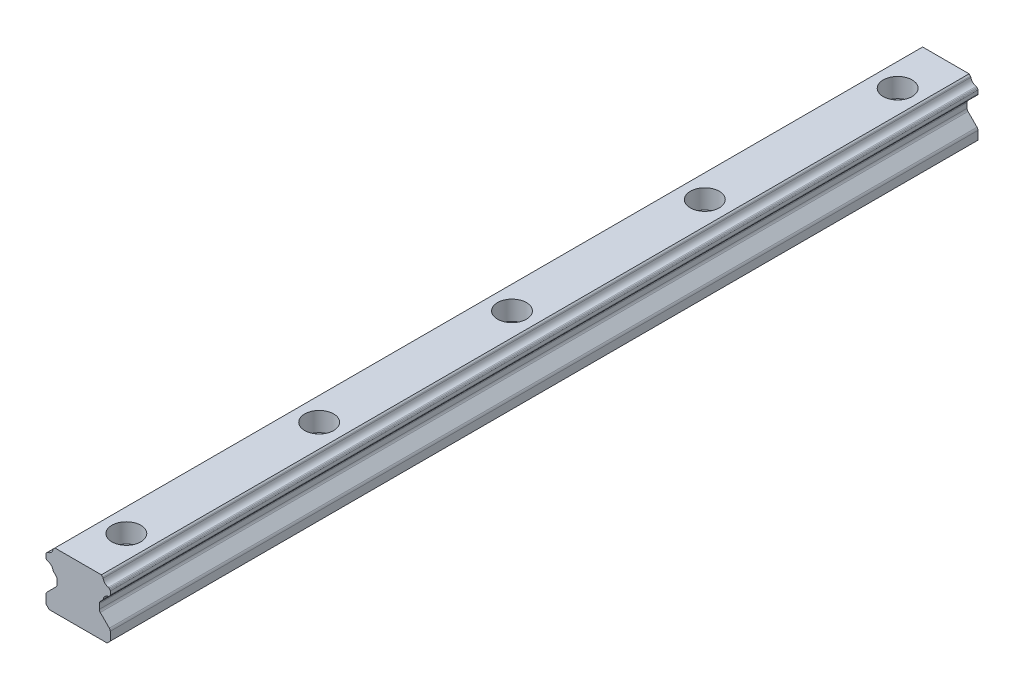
ISO-10303-21;
HEADER;
FILE_DESCRIPTION(('STEP AP214'),'2;1');
FILE_NAME('part.step','',(''),(''),'','','');
FILE_SCHEMA(('AUTOMOTIVE_DESIGN { 1 0 10303 214 1 1 1 1 }'));
ENDSEC;
DATA;
#1=APPLICATION_CONTEXT('core data for automotive mechanical design processes');
#2=APPLICATION_PROTOCOL_DEFINITION('international standard','automotive_design',2000,#1);
#3=PRODUCT_CONTEXT('',#1,'mechanical');
#4=PRODUCT('Part','Part','',(#3));
#5=PRODUCT_RELATED_PRODUCT_CATEGORY('part','',(#4));
#6=PRODUCT_DEFINITION_FORMATION('','',#4);
#7=PRODUCT_DEFINITION_CONTEXT('part definition',#1,'design');
#8=PRODUCT_DEFINITION('design','',#6,#7);
#9=PRODUCT_DEFINITION_SHAPE('','',#8);
#10=(LENGTH_UNIT() NAMED_UNIT(*) SI_UNIT(.MILLI.,.METRE.));
#11=(NAMED_UNIT(*) PLANE_ANGLE_UNIT() SI_UNIT($,.RADIAN.));
#12=(NAMED_UNIT(*) SI_UNIT($,.STERADIAN.) SOLID_ANGLE_UNIT());
#13=UNCERTAINTY_MEASURE_WITH_UNIT(LENGTH_MEASURE(1.E-05),#10,'distance_accuracy_value','');
#14=(GEOMETRIC_REPRESENTATION_CONTEXT(3) GLOBAL_UNCERTAINTY_ASSIGNED_CONTEXT((#13)) GLOBAL_UNIT_ASSIGNED_CONTEXT((#10,
#11,#12)) REPRESENTATION_CONTEXT('',''));
#15=CARTESIAN_POINT('',(0.,0.,0.));
#16=DIRECTION('',(0.,0.,1.));
#17=DIRECTION('',(1.,0.,0.));
#18=AXIS2_PLACEMENT_3D('',#15,#16,#17);
#19=CARTESIAN_POINT('',(10.,-4.033613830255,-75.));
#20=DIRECTION('',(1.,0.,0.));
#21=DIRECTION('',(0.,0.,-1.));
#22=AXIS2_PLACEMENT_3D('',#19,#20,#21);
#23=PLANE('',#22);
#24=DIRECTION('',(0.,1.,0.));
#25=VECTOR('',#24,1.);
#26=CARTESIAN_POINT('',(10.,-4.033613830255,70.));
#27=LINE('',#26,#25);
#28=CARTESIAN_POINT('',(10.,-2.976386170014,70.));
#29=VERTEX_POINT('',#28);
#30=CARTESIAN_POINT('',(10.,-4.033613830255,70.));
#31=VERTEX_POINT('',#30);
#32=EDGE_CURVE('E323',#29,#31,#27,.F.);
#33=ORIENTED_EDGE('',*,*,#32,.T.);
#34=DIRECTION('',(0.,0.,1.));
#35=VECTOR('',#34,1.);
#36=CARTESIAN_POINT('',(10.,-4.033613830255,-75.));
#37=LINE('',#36,#35);
#38=CARTESIAN_POINT('',(10.,-4.033613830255,-200.));
#39=VERTEX_POINT('',#38);
#40=EDGE_CURVE('E337',#39,#31,#37,.T.);
#41=ORIENTED_EDGE('',*,*,#40,.F.);
#42=DIRECTION('',(0.,1.,0.));
#43=VECTOR('',#42,1.);
#44=CARTESIAN_POINT('',(10.,-4.033613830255,-200.));
#45=LINE('',#44,#43);
#46=CARTESIAN_POINT('',(10.,-2.976386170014,-200.));
#47=VERTEX_POINT('',#46);
#48=EDGE_CURVE('E334',#39,#47,#45,.T.);
#49=ORIENTED_EDGE('',*,*,#48,.T.);
#50=DIRECTION('',(0.,0.,1.));
#51=VECTOR('',#50,1.);
#52=CARTESIAN_POINT('',(10.,-2.976386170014,-75.));
#53=LINE('',#52,#51);
#54=EDGE_CURVE('E329',#29,#47,#53,.F.);
#55=ORIENTED_EDGE('',*,*,#54,.F.);
#56=EDGE_LOOP('',(#33,#41,#49,#55));
#57=FACE_BOUND('',#56,.T.);
#58=ADVANCED_FACE('F16',(#57),#23,.T.);
#59=CARTESIAN_POINT('',(-10.,-2.976386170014,-75.));
#60=DIRECTION('',(-1.,8.602638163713E-13,0.));
#61=DIRECTION('',(-8.602638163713E-13,-1.,0.));
#62=AXIS2_PLACEMENT_3D('',#59,#60,#61);
#63=PLANE('',#62);
#64=DIRECTION('',(-8.602638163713E-13,-1.,0.));
#65=VECTOR('',#64,1.);
#66=CARTESIAN_POINT('',(-10.,-2.976386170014,70.));
#67=LINE('',#66,#65);
#68=CARTESIAN_POINT('',(-10.000000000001,-4.03361383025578,70.));
#69=VERTEX_POINT('',#68);
#70=CARTESIAN_POINT('',(-10.,-2.97638617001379,70.));
#71=VERTEX_POINT('',#70);
#72=EDGE_CURVE('E295',#69,#71,#67,.F.);
#73=ORIENTED_EDGE('',*,*,#72,.T.);
#74=DIRECTION('',(0.,0.,1.));
#75=VECTOR('',#74,1.);
#76=CARTESIAN_POINT('',(-10.,-2.976386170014,-75.));
#77=LINE('',#76,#75);
#78=CARTESIAN_POINT('',(-10.,-2.97638617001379,-200.));
#79=VERTEX_POINT('',#78);
#80=EDGE_CURVE('E324',#79,#71,#77,.T.);
#81=ORIENTED_EDGE('',*,*,#80,.F.);
#82=DIRECTION('',(-8.602638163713E-13,-1.,0.));
#83=VECTOR('',#82,1.);
#84=CARTESIAN_POINT('',(-10.,-2.976386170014,-200.));
#85=LINE('',#84,#83);
#86=CARTESIAN_POINT('',(-10.000000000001,-4.03361383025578,-200.));
#87=VERTEX_POINT('',#86);
#88=EDGE_CURVE('E320',#79,#87,#85,.T.);
#89=ORIENTED_EDGE('',*,*,#88,.T.);
#90=DIRECTION('',(0.,0.,1.));
#91=VECTOR('',#90,1.);
#92=CARTESIAN_POINT('',(-10.000000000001,-4.033613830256,-75.));
#93=LINE('',#92,#91);
#94=EDGE_CURVE('E314',#69,#87,#93,.F.);
#95=ORIENTED_EDGE('',*,*,#94,.F.);
#96=EDGE_LOOP('',(#73,#81,#89,#95));
#97=FACE_BOUND('',#96,.T.);
#98=ADVANCED_FACE('F798',(#97),#63,.T.);
#99=CARTESIAN_POINT('',(7.6,-8.054934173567,-75.));
#100=DIRECTION('',(0.,0.,1.));
#101=DIRECTION('',(1.,0.,0.));
#102=AXIS2_PLACEMENT_3D('',#99,#100,#101);
#103=CYLINDRICAL_SURFACE('',#102,1.);
#104=DIRECTION('',(0.,0.,1.));
#105=VECTOR('',#104,1.);
#106=CARTESIAN_POINT('',(6.8928932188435,-7.3478273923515,-75.));
#107=LINE('',#106,#105);
#108=CARTESIAN_POINT('',(6.89289321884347,-7.34782739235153,70.));
#109=VERTEX_POINT('',#108);
#110=CARTESIAN_POINT('',(6.89289321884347,-7.34782739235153,-200.));
#111=VERTEX_POINT('',#110);
#112=EDGE_CURVE('E291',#109,#111,#107,.F.);
#113=ORIENTED_EDGE('',*,*,#112,.F.);
#114=CARTESIAN_POINT('',(7.6,-8.054934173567,70.));
#115=DIRECTION('',(0.,0.,1.));
#116=DIRECTION('',(1.,0.,0.));
#117=AXIS2_PLACEMENT_3D('',#114,#115,#116);
#118=CIRCLE('',#117,1.);
#119=CARTESIAN_POINT('',(6.6,-8.054934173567,70.));
#120=VERTEX_POINT('',#119);
#121=EDGE_CURVE('E19',#120,#109,#118,.F.);
#122=ORIENTED_EDGE('',*,*,#121,.F.);
#123=DIRECTION('',(0.,0.,-1.));
#124=VECTOR('',#123,1.);
#125=CARTESIAN_POINT('',(6.6,-8.054934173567,-75.));
#126=LINE('',#125,#124);
#127=CARTESIAN_POINT('',(6.6,-8.054934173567,-200.));
#128=VERTEX_POINT('',#127);
#129=EDGE_CURVE('E288',#128,#120,#126,.F.);
#130=ORIENTED_EDGE('',*,*,#129,.F.);
#131=CARTESIAN_POINT('',(7.6,-8.054934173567,-200.));
#132=DIRECTION('',(0.,0.,1.));
#133=DIRECTION('',(1.,0.,0.));
#134=AXIS2_PLACEMENT_3D('',#131,#132,#133);
#135=CIRCLE('',#134,1.);
#136=EDGE_CURVE('E294',#111,#128,#135,.T.);
#137=ORIENTED_EDGE('',*,*,#136,.F.);
#138=EDGE_LOOP('',(#113,#122,#130,#137));
#139=FACE_BOUND('',#138,.T.);
#140=ADVANCED_FACE('F285',(#139),#103,.F.);
#141=CARTESIAN_POINT('',(9.5,-4.033613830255,-75.));
#142=DIRECTION('',(0.,0.,1.));
#143=DIRECTION('',(1.,0.,0.));
#144=AXIS2_PLACEMENT_3D('',#141,#142,#143);
#145=CYLINDRICAL_SURFACE('',#144,0.5);
#146=CARTESIAN_POINT('',(9.5,-4.033613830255,70.));
#147=DIRECTION('',(0.,0.,1.));
#148=DIRECTION('',(1.,0.,0.));
#149=AXIS2_PLACEMENT_3D('',#146,#147,#148);
#150=CIRCLE('',#149,0.5);
#151=CARTESIAN_POINT('',(9.85355339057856,-4.38716722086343,70.));
#152=VERTEX_POINT('',#151);
#153=EDGE_CURVE('E340',#31,#152,#150,.F.);
#154=ORIENTED_EDGE('',*,*,#153,.T.);
#155=DIRECTION('',(0.,0.,1.));
#156=VECTOR('',#155,1.);
#157=CARTESIAN_POINT('',(9.8535533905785,-4.3871672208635,-75.));
#158=LINE('',#157,#156);
#159=CARTESIAN_POINT('',(9.85355339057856,-4.38716722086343,-200.));
#160=VERTEX_POINT('',#159);
#161=EDGE_CURVE('E533',#160,#152,#158,.T.);
#162=ORIENTED_EDGE('',*,*,#161,.F.);
#163=CARTESIAN_POINT('',(9.5,-4.033613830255,-200.));
#164=DIRECTION('',(0.,0.,1.));
#165=DIRECTION('',(1.,0.,0.));
#166=AXIS2_PLACEMENT_3D('',#163,#164,#165);
#167=CIRCLE('',#166,0.5);
#168=EDGE_CURVE('E341',#160,#39,#167,.T.);
#169=ORIENTED_EDGE('',*,*,#168,.T.);
#170=ORIENTED_EDGE('',*,*,#40,.T.);
#171=EDGE_LOOP('',(#154,#162,#169,#170));
#172=FACE_BOUND('',#171,.T.);
#173=ADVANCED_FACE('F852',(#172),#145,.T.);
#174=CARTESIAN_POINT('',(9.5,-2.976386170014,-75.));
#175=DIRECTION('',(0.,0.,1.));
#176=DIRECTION('',(1.,0.,0.));
#177=AXIS2_PLACEMENT_3D('',#174,#175,#176);
#178=CYLINDRICAL_SURFACE('',#177,0.5);
#179=CARTESIAN_POINT('',(9.5,-2.976386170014,70.));
#180=DIRECTION('',(0.,0.,1.));
#181=DIRECTION('',(1.,0.,0.));
#182=AXIS2_PLACEMENT_3D('',#179,#180,#181);
#183=CIRCLE('',#182,0.5);
#184=CARTESIAN_POINT('',(9.85355339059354,-2.62283277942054,70.));
#185=VERTEX_POINT('',#184);
#186=EDGE_CURVE('E332',#185,#29,#183,.F.);
#187=ORIENTED_EDGE('',*,*,#186,.T.);
#188=ORIENTED_EDGE('',*,*,#54,.T.);
#189=CARTESIAN_POINT('',(9.5,-2.976386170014,-200.));
#190=DIRECTION('',(0.,0.,1.));
#191=DIRECTION('',(1.,0.,0.));
#192=AXIS2_PLACEMENT_3D('',#189,#190,#191);
#193=CIRCLE('',#192,0.5);
#194=CARTESIAN_POINT('',(9.85355339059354,-2.62283277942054,-200.));
#195=VERTEX_POINT('',#194);
#196=EDGE_CURVE('E518',#47,#195,#193,.T.);
#197=ORIENTED_EDGE('',*,*,#196,.T.);
#198=DIRECTION('',(0.,0.,1.));
#199=VECTOR('',#198,1.);
#200=CARTESIAN_POINT('',(9.85355339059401,-2.62283277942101,-75.));
#201=LINE('',#200,#199);
#202=EDGE_CURVE('E557',#185,#195,#201,.F.);
#203=ORIENTED_EDGE('',*,*,#202,.F.);
#204=EDGE_LOOP('',(#187,#188,#197,#203));
#205=FACE_BOUND('',#204,.T.);
#206=ADVANCED_FACE('F848',(#205),#178,.T.);
#207=CARTESIAN_POINT('',(-9.5,-2.976386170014,-75.));
#208=DIRECTION('',(0.,0.,1.));
#209=DIRECTION('',(1.,0.,0.));
#210=AXIS2_PLACEMENT_3D('',#207,#208,#209);
#211=CYLINDRICAL_SURFACE('',#210,0.5);
#212=CARTESIAN_POINT('',(-9.5,-2.976386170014,70.));
#213=DIRECTION('',(0.,0.,1.));
#214=DIRECTION('',(1.,0.,0.));
#215=AXIS2_PLACEMENT_3D('',#212,#213,#214);
#216=CIRCLE('',#215,0.5);
#217=CARTESIAN_POINT('',(-9.85355339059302,-2.62283277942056,70.));
#218=VERTEX_POINT('',#217);
#219=EDGE_CURVE('E327',#71,#218,#216,.F.);
#220=ORIENTED_EDGE('',*,*,#219,.T.);
#221=DIRECTION('',(0.,0.,1.));
#222=VECTOR('',#221,1.);
#223=CARTESIAN_POINT('',(-9.85355339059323,-2.62283277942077,-75.));
#224=LINE('',#223,#222);
#225=CARTESIAN_POINT('',(-9.85355339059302,-2.62283277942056,-200.));
#226=VERTEX_POINT('',#225);
#227=EDGE_CURVE('E552',#226,#218,#224,.T.);
#228=ORIENTED_EDGE('',*,*,#227,.F.);
#229=CARTESIAN_POINT('',(-9.5,-2.976386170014,-200.));
#230=DIRECTION('',(0.,0.,1.));
#231=DIRECTION('',(1.,0.,0.));
#232=AXIS2_PLACEMENT_3D('',#229,#230,#231);
#233=CIRCLE('',#232,0.5);
#234=EDGE_CURVE('E328',#226,#79,#233,.T.);
#235=ORIENTED_EDGE('',*,*,#234,.T.);
#236=ORIENTED_EDGE('',*,*,#80,.T.);
#237=EDGE_LOOP('',(#220,#228,#235,#236));
#238=FACE_BOUND('',#237,.T.);
#239=ADVANCED_FACE('F802',(#238),#211,.T.);
#240=CARTESIAN_POINT('',(-9.500000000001,-4.033613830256,-75.));
#241=DIRECTION('',(0.,0.,1.));
#242=DIRECTION('',(1.,0.,0.));
#243=AXIS2_PLACEMENT_3D('',#240,#241,#242);
#244=CYLINDRICAL_SURFACE('',#243,0.5);
#245=CARTESIAN_POINT('',(-9.500000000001,-4.033613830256,70.));
#246=DIRECTION('',(0.,0.,1.));
#247=DIRECTION('',(1.,0.,0.));
#248=AXIS2_PLACEMENT_3D('',#245,#246,#247);
#249=CIRCLE('',#248,0.5);
#250=CARTESIAN_POINT('',(-9.85355339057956,-4.38716722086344,70.));
#251=VERTEX_POINT('',#250);
#252=EDGE_CURVE('E318',#251,#69,#249,.F.);
#253=ORIENTED_EDGE('',*,*,#252,.T.);
#254=ORIENTED_EDGE('',*,*,#94,.T.);
#255=CARTESIAN_POINT('',(-9.500000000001,-4.033613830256,-200.));
#256=DIRECTION('',(0.,0.,1.));
#257=DIRECTION('',(1.,0.,0.));
#258=AXIS2_PLACEMENT_3D('',#255,#256,#257);
#259=CIRCLE('',#258,0.5);
#260=CARTESIAN_POINT('',(-9.85355339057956,-4.38716722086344,-200.));
#261=VERTEX_POINT('',#260);
#262=EDGE_CURVE('E510',#87,#261,#259,.T.);
#263=ORIENTED_EDGE('',*,*,#262,.T.);
#264=DIRECTION('',(0.,0.,1.));
#265=VECTOR('',#264,1.);
#266=CARTESIAN_POINT('',(-9.85355339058,-4.387167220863,-75.));
#267=LINE('',#266,#265);
#268=EDGE_CURVE('E548',#251,#261,#267,.F.);
#269=ORIENTED_EDGE('',*,*,#268,.F.);
#270=EDGE_LOOP('',(#253,#254,#263,#269));
#271=FACE_BOUND('',#270,.T.);
#272=ADVANCED_FACE('F794',(#271),#244,.T.);
#273=CARTESIAN_POINT('',(-7.6,-8.054934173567,-75.));
#274=DIRECTION('',(0.,0.,1.));
#275=DIRECTION('',(1.,0.,0.));
#276=AXIS2_PLACEMENT_3D('',#273,#274,#275);
#277=CYLINDRICAL_SURFACE('',#276,1.);
#278=DIRECTION('',(0.,0.,1.));
#279=VECTOR('',#278,1.);
#280=CARTESIAN_POINT('',(-6.6,-8.054934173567,-75.));
#281=LINE('',#280,#279);
#282=CARTESIAN_POINT('',(-6.6,-8.05493417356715,70.));
#283=VERTEX_POINT('',#282);
#284=CARTESIAN_POINT('',(-6.6,-8.05493417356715,-200.));
#285=VERTEX_POINT('',#284);
#286=EDGE_CURVE('E505',#283,#285,#281,.F.);
#287=ORIENTED_EDGE('',*,*,#286,.F.);
#288=CARTESIAN_POINT('',(-7.6,-8.054934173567,70.));
#289=DIRECTION('',(0.,0.,1.));
#290=DIRECTION('',(1.,0.,0.));
#291=AXIS2_PLACEMENT_3D('',#288,#289,#290);
#292=CIRCLE('',#291,1.);
#293=CARTESIAN_POINT('',(-6.89289321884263,-7.34782739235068,70.));
#294=VERTEX_POINT('',#293);
#295=EDGE_CURVE('E317',#294,#283,#292,.F.);
#296=ORIENTED_EDGE('',*,*,#295,.F.);
#297=DIRECTION('',(0.,0.,1.));
#298=VECTOR('',#297,1.);
#299=CARTESIAN_POINT('',(-6.89289321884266,-7.34782739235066,-75.));
#300=LINE('',#299,#298);
#301=CARTESIAN_POINT('',(-6.89289321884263,-7.34782739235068,-200.));
#302=VERTEX_POINT('',#301);
#303=EDGE_CURVE('E543',#302,#294,#300,.T.);
#304=ORIENTED_EDGE('',*,*,#303,.F.);
#305=CARTESIAN_POINT('',(-7.6,-8.054934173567,-200.));
#306=DIRECTION('',(0.,0.,1.));
#307=DIRECTION('',(1.,0.,0.));
#308=AXIS2_PLACEMENT_3D('',#305,#306,#307);
#309=CIRCLE('',#308,1.);
#310=EDGE_CURVE('E309',#285,#302,#309,.T.);
#311=ORIENTED_EDGE('',*,*,#310,.F.);
#312=EDGE_LOOP('',(#287,#296,#304,#311));
#313=FACE_BOUND('',#312,.T.);
#314=ADVANCED_FACE('F773',(#313),#277,.F.);
#315=CARTESIAN_POINT('',(6.6,-9.615065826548,-75.));
#316=DIRECTION('',(1.,0.,0.));
#317=DIRECTION('',(0.,0.,-1.));
#318=AXIS2_PLACEMENT_3D('',#315,#316,#317);
#319=PLANE('',#318);
#320=DIRECTION('',(0.,1.,0.));
#321=VECTOR('',#320,1.);
#322=CARTESIAN_POINT('',(6.6,-9.615065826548,70.));
#323=LINE('',#322,#321);
#324=CARTESIAN_POINT('',(6.6,-9.615065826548,70.));
#325=VERTEX_POINT('',#324);
#326=EDGE_CURVE('E297',#120,#325,#323,.F.);
#327=ORIENTED_EDGE('',*,*,#326,.T.);
#328=DIRECTION('',(0.,0.,1.));
#329=VECTOR('',#328,1.);
#330=CARTESIAN_POINT('',(6.6,-9.615065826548,-75.));
#331=LINE('',#330,#329);
#332=CARTESIAN_POINT('',(6.6,-9.615065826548,-200.));
#333=VERTEX_POINT('',#332);
#334=EDGE_CURVE('E503',#325,#333,#331,.F.);
#335=ORIENTED_EDGE('',*,*,#334,.T.);
#336=DIRECTION('',(0.,1.,0.));
#337=VECTOR('',#336,1.);
#338=CARTESIAN_POINT('',(6.6,-9.615065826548,-200.));
#339=LINE('',#338,#337);
#340=EDGE_CURVE('E307',#333,#128,#339,.T.);
#341=ORIENTED_EDGE('',*,*,#340,.T.);
#342=ORIENTED_EDGE('',*,*,#129,.T.);
#343=EDGE_LOOP('',(#327,#335,#341,#342));
#344=FACE_BOUND('',#343,.T.);
#345=ADVANCED_FACE('F306',(#344),#319,.T.);
#346=CARTESIAN_POINT('',(6.892893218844,-7.347827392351,-75.));
#347=DIRECTION('',(0.707106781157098,-0.707106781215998,0.));
#348=DIRECTION('',(0.707106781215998,0.707106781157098,0.));
#349=AXIS2_PLACEMENT_3D('',#346,#347,#348);
#350=PLANE('',#349);
#351=DIRECTION('',(0.707106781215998,0.707106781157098,0.));
#352=VECTOR('',#351,1.);
#353=CARTESIAN_POINT('',(6.892893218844,-7.347827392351,70.));
#354=LINE('',#353,#352);
#355=CARTESIAN_POINT('',(7.64543361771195,-6.59528699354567,70.));
#356=VERTEX_POINT('',#355);
#357=EDGE_CURVE('E530',#356,#109,#354,.F.);
#358=ORIENTED_EDGE('',*,*,#357,.T.);
#359=ORIENTED_EDGE('',*,*,#112,.T.);
#360=DIRECTION('',(0.707106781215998,0.707106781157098,0.));
#361=VECTOR('',#360,1.);
#362=CARTESIAN_POINT('',(6.892893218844,-7.347827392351,-200.));
#363=LINE('',#362,#361);
#364=CARTESIAN_POINT('',(7.64543361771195,-6.59528699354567,-200.));
#365=VERTEX_POINT('',#364);
#366=EDGE_CURVE('E304',#111,#365,#363,.T.);
#367=ORIENTED_EDGE('',*,*,#366,.T.);
#368=DIRECTION('',(0.,0.,1.));
#369=VECTOR('',#368,1.);
#370=CARTESIAN_POINT('',(7.64543361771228,-6.59528699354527,-75.));
#371=LINE('',#370,#369);
#372=EDGE_CURVE('E491',#356,#365,#371,.F.);
#373=ORIENTED_EDGE('',*,*,#372,.F.);
#374=EDGE_LOOP('',(#358,#359,#367,#373));
#375=FACE_BOUND('',#374,.T.);
#376=ADVANCED_FACE('F527',(#375),#350,.T.);
#377=CARTESIAN_POINT('',(9.675343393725,-4.565377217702,-75.));
#378=DIRECTION('',(0.707106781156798,-0.707106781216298,0.));
#379=DIRECTION('',(0.707106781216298,0.707106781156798,0.));
#380=AXIS2_PLACEMENT_3D('',#377,#378,#379);
#381=PLANE('',#380);
#382=DIRECTION('',(0.707106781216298,0.707106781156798,0.));
#383=VECTOR('',#382,1.);
#384=CARTESIAN_POINT('',(9.675343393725,-4.565377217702,70.));
#385=LINE('',#384,#383);
#386=CARTESIAN_POINT('',(9.67534339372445,-4.56537721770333,70.));
#387=VERTEX_POINT('',#386);
#388=EDGE_CURVE('E561',#152,#387,#385,.F.);
#389=ORIENTED_EDGE('',*,*,#388,.T.);
#390=DIRECTION('',(0.,0.,1.));
#391=VECTOR('',#390,1.);
#392=CARTESIAN_POINT('',(9.67534339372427,-4.56537721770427,-75.));
#393=LINE('',#392,#391);
#394=CARTESIAN_POINT('',(9.67534339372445,-4.56537721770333,-200.));
#395=VERTEX_POINT('',#394);
#396=EDGE_CURVE('E487',#395,#387,#393,.T.);
#397=ORIENTED_EDGE('',*,*,#396,.F.);
#398=DIRECTION('',(0.707106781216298,0.707106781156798,0.));
#399=VECTOR('',#398,1.);
#400=CARTESIAN_POINT('',(9.675343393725,-4.565377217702,-200.));
#401=LINE('',#400,#399);
#402=EDGE_CURVE('E531',#395,#160,#401,.T.);
#403=ORIENTED_EDGE('',*,*,#402,.T.);
#404=ORIENTED_EDGE('',*,*,#161,.T.);
#405=EDGE_LOOP('',(#389,#397,#403,#404));
#406=FACE_BOUND('',#405,.T.);
#407=ADVANCED_FACE('F854',(#406),#381,.T.);
#408=CARTESIAN_POINT('',(9.853553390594,-2.622832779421,-75.));
#409=DIRECTION('',(0.707106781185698,0.707106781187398,0.));
#410=DIRECTION('',(-0.707106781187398,0.707106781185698,0.));
#411=AXIS2_PLACEMENT_3D('',#408,#409,#410);
#412=PLANE('',#411);
#413=DIRECTION('',(-0.707106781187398,0.707106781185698,0.));
#414=VECTOR('',#413,1.);
#415=CARTESIAN_POINT('',(9.853553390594,-2.622832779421,70.));
#416=LINE('',#415,#414);
#417=CARTESIAN_POINT('',(9.66334833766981,-2.43262772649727,70.));
#418=VERTEX_POINT('',#417);
#419=EDGE_CURVE('E559',#418,#185,#416,.F.);
#420=ORIENTED_EDGE('',*,*,#419,.T.);
#421=ORIENTED_EDGE('',*,*,#202,.T.);
#422=DIRECTION('',(-0.707106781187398,0.707106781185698,0.));
#423=VECTOR('',#422,1.);
#424=CARTESIAN_POINT('',(9.853553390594,-2.622832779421,-200.));
#425=LINE('',#424,#423);
#426=CARTESIAN_POINT('',(9.66334833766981,-2.43262772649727,-200.));
#427=VERTEX_POINT('',#426);
#428=EDGE_CURVE('E564',#195,#427,#425,.T.);
#429=ORIENTED_EDGE('',*,*,#428,.T.);
#430=DIRECTION('',(0.,0.,1.));
#431=VECTOR('',#430,1.);
#432=CARTESIAN_POINT('',(9.66334833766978,-2.43262772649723,-75.));
#433=LINE('',#432,#431);
#434=EDGE_CURVE('E479',#418,#427,#433,.F.);
#435=ORIENTED_EDGE('',*,*,#434,.F.);
#436=EDGE_LOOP('',(#420,#421,#429,#435));
#437=FACE_BOUND('',#436,.T.);
#438=ADVANCED_FACE('F842',(#437),#412,.T.);
#439=CARTESIAN_POINT('',(-9.66334833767,-2.432627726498,-75.));
#440=DIRECTION('',(-0.707106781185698,0.707106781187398,0.));
#441=DIRECTION('',(-0.707106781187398,-0.707106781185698,0.));
#442=AXIS2_PLACEMENT_3D('',#439,#440,#441);
#443=PLANE('',#442);
#444=DIRECTION('',(-0.707106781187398,-0.707106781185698,0.));
#445=VECTOR('',#444,1.);
#446=CARTESIAN_POINT('',(-9.66334833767,-2.432627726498,70.));
#447=LINE('',#446,#445);
#448=CARTESIAN_POINT('',(-9.66334833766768,-2.43262772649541,70.));
#449=VERTEX_POINT('',#448);
#450=EDGE_CURVE('E555',#218,#449,#447,.F.);
#451=ORIENTED_EDGE('',*,*,#450,.T.);
#452=DIRECTION('',(0.,0.,1.));
#453=VECTOR('',#452,1.);
#454=CARTESIAN_POINT('',(-9.66334833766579,-2.43262772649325,-75.));
#455=LINE('',#454,#453);
#456=CARTESIAN_POINT('',(-9.66334833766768,-2.43262772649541,-200.));
#457=VERTEX_POINT('',#456);
#458=EDGE_CURVE('E462',#457,#449,#455,.T.);
#459=ORIENTED_EDGE('',*,*,#458,.F.);
#460=DIRECTION('',(-0.707106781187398,-0.707106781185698,0.));
#461=VECTOR('',#460,1.);
#462=CARTESIAN_POINT('',(-9.66334833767,-2.432627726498,-200.));
#463=LINE('',#462,#461);
#464=EDGE_CURVE('E556',#457,#226,#463,.T.);
#465=ORIENTED_EDGE('',*,*,#464,.T.);
#466=ORIENTED_EDGE('',*,*,#227,.T.);
#467=EDGE_LOOP('',(#451,#459,#465,#466));
#468=FACE_BOUND('',#467,.T.);
#469=ADVANCED_FACE('F806',(#468),#443,.T.);
#470=CARTESIAN_POINT('',(-9.853553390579,-4.387167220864,-75.));
#471=DIRECTION('',(-0.707106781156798,-0.707106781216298,0.));
#472=DIRECTION('',(0.707106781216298,-0.707106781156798,0.));
#473=AXIS2_PLACEMENT_3D('',#470,#471,#472);
#474=PLANE('',#473);
#475=DIRECTION('',(0.707106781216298,-0.707106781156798,0.));
#476=VECTOR('',#475,1.);
#477=CARTESIAN_POINT('',(-9.853553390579,-4.387167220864,70.));
#478=LINE('',#477,#476);
#479=CARTESIAN_POINT('',(-9.67534339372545,-4.56537721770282,70.));
#480=VERTEX_POINT('',#479);
#481=EDGE_CURVE('E551',#480,#251,#478,.F.);
#482=ORIENTED_EDGE('',*,*,#481,.T.);
#483=ORIENTED_EDGE('',*,*,#268,.T.);
#484=DIRECTION('',(0.707106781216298,-0.707106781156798,0.));
#485=VECTOR('',#484,1.);
#486=CARTESIAN_POINT('',(-9.853553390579,-4.387167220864,-200.));
#487=LINE('',#486,#485);
#488=CARTESIAN_POINT('',(-9.67534339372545,-4.56537721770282,-200.));
#489=VERTEX_POINT('',#488);
#490=EDGE_CURVE('E620',#261,#489,#487,.T.);
#491=ORIENTED_EDGE('',*,*,#490,.T.);
#492=DIRECTION('',(0.,0.,1.));
#493=VECTOR('',#492,1.);
#494=CARTESIAN_POINT('',(-9.67534339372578,-4.56537721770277,-75.));
#495=LINE('',#494,#493);
#496=EDGE_CURVE('E454',#480,#489,#495,.F.);
#497=ORIENTED_EDGE('',*,*,#496,.F.);
#498=EDGE_LOOP('',(#482,#483,#491,#497));
#499=FACE_BOUND('',#498,.T.);
#500=ADVANCED_FACE('F791',(#499),#474,.T.);
#501=CARTESIAN_POINT('',(-7.645433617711,-6.595286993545,-75.));
#502=DIRECTION('',(-0.707106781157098,-0.707106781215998,0.));
#503=DIRECTION('',(0.707106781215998,-0.707106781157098,0.));
#504=AXIS2_PLACEMENT_3D('',#501,#502,#503);
#505=PLANE('',#504);
#506=DIRECTION('',(0.707106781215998,-0.707106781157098,0.));
#507=VECTOR('',#506,1.);
#508=CARTESIAN_POINT('',(-7.645433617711,-6.595286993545,70.));
#509=LINE('',#508,#507);
#510=CARTESIAN_POINT('',(-7.64543361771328,-6.5952869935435,70.));
#511=VERTEX_POINT('',#510);
#512=EDGE_CURVE('E546',#294,#511,#509,.F.);
#513=ORIENTED_EDGE('',*,*,#512,.T.);
#514=DIRECTION('',(0.,0.,1.));
#515=VECTOR('',#514,1.);
#516=CARTESIAN_POINT('',(-7.64543361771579,-6.59528699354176,-75.));
#517=LINE('',#516,#515);
#518=CARTESIAN_POINT('',(-7.64543361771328,-6.5952869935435,-200.));
#519=VERTEX_POINT('',#518);
#520=EDGE_CURVE('E450',#519,#511,#517,.T.);
#521=ORIENTED_EDGE('',*,*,#520,.F.);
#522=DIRECTION('',(0.707106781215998,-0.707106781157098,0.));
#523=VECTOR('',#522,1.);
#524=CARTESIAN_POINT('',(-7.645433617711,-6.595286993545,-200.));
#525=LINE('',#524,#523);
#526=EDGE_CURVE('E547',#519,#302,#525,.T.);
#527=ORIENTED_EDGE('',*,*,#526,.T.);
#528=ORIENTED_EDGE('',*,*,#303,.T.);
#529=EDGE_LOOP('',(#513,#521,#527,#528));
#530=FACE_BOUND('',#529,.T.);
#531=ADVANCED_FACE('F777',(#530),#505,.T.);
#532=CARTESIAN_POINT('',(-6.6,-8.054934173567,-75.));
#533=DIRECTION('',(-1.,2.909108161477E-13,0.));
#534=DIRECTION('',(-2.909108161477E-13,-1.,0.));
#535=AXIS2_PLACEMENT_3D('',#532,#533,#534);
#536=PLANE('',#535);
#537=DIRECTION('',(-2.909108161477E-13,-1.,0.));
#538=VECTOR('',#537,1.);
#539=CARTESIAN_POINT('',(-6.6,-8.054934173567,70.));
#540=LINE('',#539,#538);
#541=CARTESIAN_POINT('',(-6.60000000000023,-9.61506582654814,70.));
#542=VERTEX_POINT('',#541);
#543=EDGE_CURVE('E542',#542,#283,#540,.F.);
#544=ORIENTED_EDGE('',*,*,#543,.T.);
#545=ORIENTED_EDGE('',*,*,#286,.T.);
#546=DIRECTION('',(-2.909108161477E-13,-1.,0.));
#547=VECTOR('',#546,1.);
#548=CARTESIAN_POINT('',(-6.6,-8.054934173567,-200.));
#549=LINE('',#548,#547);
#550=CARTESIAN_POINT('',(-6.60000000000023,-9.61506582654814,-200.));
#551=VERTEX_POINT('',#550);
#552=EDGE_CURVE('E632',#285,#551,#549,.T.);
#553=ORIENTED_EDGE('',*,*,#552,.T.);
#554=DIRECTION('',(0.,0.,1.));
#555=VECTOR('',#554,1.);
#556=CARTESIAN_POINT('',(-6.6,-9.615065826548,-75.));
#557=LINE('',#556,#555);
#558=EDGE_CURVE('E447',#551,#542,#557,.T.);
#559=ORIENTED_EDGE('',*,*,#558,.T.);
#560=EDGE_LOOP('',(#544,#545,#553,#559));
#561=FACE_BOUND('',#560,.T.);
#562=ADVANCED_FACE('F768',(#561),#536,.T.);
#563=CARTESIAN_POINT('',(7.6,-9.615065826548,-75.));
#564=DIRECTION('',(0.,0.,1.));
#565=DIRECTION('',(1.,0.,0.));
#566=AXIS2_PLACEMENT_3D('',#563,#564,#565);
#567=CYLINDRICAL_SURFACE('',#566,1.);
#568=ORIENTED_EDGE('',*,*,#334,.F.);
#569=CARTESIAN_POINT('',(7.6,-9.615065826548,70.));
#570=DIRECTION('',(0.,0.,1.));
#571=DIRECTION('',(1.,0.,0.));
#572=AXIS2_PLACEMENT_3D('',#569,#570,#571);
#573=CIRCLE('',#572,1.);
#574=CARTESIAN_POINT('',(6.89289321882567,-10.3221726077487,70.));
#575=VERTEX_POINT('',#574);
#576=EDGE_CURVE('E300',#575,#325,#573,.F.);
#577=ORIENTED_EDGE('',*,*,#576,.F.);
#578=DIRECTION('',(0.,0.,1.));
#579=VECTOR('',#578,1.);
#580=CARTESIAN_POINT('',(6.89289321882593,-10.322172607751,-75.));
#581=LINE('',#580,#579);
#582=CARTESIAN_POINT('',(6.89289321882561,-10.3221726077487,-200.));
#583=VERTEX_POINT('',#582);
#584=EDGE_CURVE('E679',#583,#575,#581,.T.);
#585=ORIENTED_EDGE('',*,*,#584,.F.);
#586=CARTESIAN_POINT('',(7.6,-9.615065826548,-200.));
#587=DIRECTION('',(0.,0.,1.));
#588=DIRECTION('',(1.,0.,0.));
#589=AXIS2_PLACEMENT_3D('',#586,#587,#588);
#590=CIRCLE('',#589,1.);
#591=EDGE_CURVE('E501',#333,#583,#590,.T.);
#592=ORIENTED_EDGE('',*,*,#591,.F.);
#593=EDGE_LOOP('',(#568,#577,#585,#592));
#594=FACE_BOUND('',#593,.T.);
#595=ADVANCED_FACE('F874',(#594),#567,.F.);
#596=CARTESIAN_POINT('',(9.,-13.8434929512,-75.));
#597=DIRECTION('',(0.,0.,1.));
#598=DIRECTION('',(1.,0.,0.));
#599=AXIS2_PLACEMENT_3D('',#596,#597,#598);
#600=CYLINDRICAL_SURFACE('',#599,1.);
#601=CARTESIAN_POINT('',(9.,-13.8434929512,70.));
#602=DIRECTION('',(0.,0.,1.));
#603=DIRECTION('',(1.,0.,0.));
#604=AXIS2_PLACEMENT_3D('',#601,#602,#603);
#605=CIRCLE('',#604,1.);
#606=CARTESIAN_POINT('',(9.70710678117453,-13.1363861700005,70.));
#607=VERTEX_POINT('',#606);
#608=CARTESIAN_POINT('',(10.,-13.8434929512,70.));
#609=VERTEX_POINT('',#608);
#610=EDGE_CURVE('E497',#607,#609,#605,.F.);
#611=ORIENTED_EDGE('',*,*,#610,.T.);
#612=DIRECTION('',(0.,0.,-1.));
#613=VECTOR('',#612,1.);
#614=CARTESIAN_POINT('',(10.,-13.8434929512,-75.));
#615=LINE('',#614,#613);
#616=CARTESIAN_POINT('',(10.,-13.8434929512,-200.));
#617=VERTEX_POINT('',#616);
#618=EDGE_CURVE('E425',#617,#609,#615,.F.);
#619=ORIENTED_EDGE('',*,*,#618,.F.);
#620=CARTESIAN_POINT('',(9.,-13.8434929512,-200.));
#621=DIRECTION('',(0.,0.,1.));
#622=DIRECTION('',(1.,0.,0.));
#623=AXIS2_PLACEMENT_3D('',#620,#621,#622);
#624=CIRCLE('',#623,1.);
#625=CARTESIAN_POINT('',(9.70710678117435,-13.1363861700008,-200.));
#626=VERTEX_POINT('',#625);
#627=EDGE_CURVE('E499',#617,#626,#624,.T.);
#628=ORIENTED_EDGE('',*,*,#627,.T.);
#629=DIRECTION('',(0.,0.,1.));
#630=VECTOR('',#629,1.);
#631=CARTESIAN_POINT('',(9.707106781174,-13.13638617,-75.));
#632=LINE('',#631,#630);
#633=EDGE_CURVE('E682',#607,#626,#632,.F.);
#634=ORIENTED_EDGE('',*,*,#633,.F.);
#635=EDGE_LOOP('',(#611,#619,#628,#634));
#636=FACE_BOUND('',#635,.T.);
#637=ADVANCED_FACE('F865',(#636),#600,.T.);
#638=CARTESIAN_POINT('',(7.291880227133,-6.241733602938,-75.));
#639=DIRECTION('',(0.,0.,1.));
#640=DIRECTION('',(1.,0.,0.));
#641=AXIS2_PLACEMENT_3D('',#638,#639,#640);
#642=CYLINDRICAL_SURFACE('',#641,0.5);
#643=CARTESIAN_POINT('',(7.291880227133,-6.241733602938,70.));
#644=DIRECTION('',(0.,0.,1.));
#645=DIRECTION('',(1.,0.,0.));
#646=AXIS2_PLACEMENT_3D('',#643,#644,#645);
#647=CIRCLE('',#646,0.5);
#648=CARTESIAN_POINT('',(7.78361033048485,-6.33229576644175,70.));
#649=VERTEX_POINT('',#648);
#650=EDGE_CURVE('E492',#649,#356,#647,.F.);
#651=ORIENTED_EDGE('',*,*,#650,.T.);
#652=ORIENTED_EDGE('',*,*,#372,.T.);
#653=CARTESIAN_POINT('',(7.291880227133,-6.241733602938,-200.));
#654=DIRECTION('',(0.,0.,1.));
#655=DIRECTION('',(1.,0.,0.));
#656=AXIS2_PLACEMENT_3D('',#653,#654,#655);
#657=CIRCLE('',#656,0.5);
#658=CARTESIAN_POINT('',(7.78361033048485,-6.33229576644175,-200.));
#659=VERTEX_POINT('',#658);
#660=EDGE_CURVE('E495',#365,#659,#657,.T.);
#661=ORIENTED_EDGE('',*,*,#660,.T.);
#662=DIRECTION('',(0.,0.,1.));
#663=VECTOR('',#662,1.);
#664=CARTESIAN_POINT('',(7.78361033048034,-6.33229576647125,-75.));
#665=LINE('',#664,#663);
#666=EDGE_CURVE('E685',#659,#649,#665,.T.);
#667=ORIENTED_EDGE('',*,*,#666,.T.);
#668=EDGE_LOOP('',(#651,#652,#661,#667));
#669=FACE_BOUND('',#668,.T.);
#670=ADVANCED_FACE('F863',(#669),#642,.T.);
#671=CARTESIAN_POINT('',(9.321790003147,-4.211823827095,-75.));
#672=DIRECTION('',(0.,0.,1.));
#673=DIRECTION('',(1.,0.,0.));
#674=AXIS2_PLACEMENT_3D('',#671,#672,#673);
#675=CYLINDRICAL_SURFACE('',#674,0.5);
#676=CARTESIAN_POINT('',(9.321790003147,-4.211823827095,70.));
#677=DIRECTION('',(0.,0.,1.));
#678=DIRECTION('',(1.,0.,0.));
#679=AXIS2_PLACEMENT_3D('',#676,#677,#678);
#680=CIRCLE('',#679,0.5);
#681=CARTESIAN_POINT('',(9.4123521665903,-4.70355393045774,70.));
#682=VERTEX_POINT('',#681);
#683=EDGE_CURVE('E485',#387,#682,#680,.F.);
#684=ORIENTED_EDGE('',*,*,#683,.T.);
#685=DIRECTION('',(0.,0.,1.));
#686=VECTOR('',#685,1.);
#687=CARTESIAN_POINT('',(9.41235216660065,-4.70355393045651,-75.));
#688=LINE('',#687,#686);
#689=CARTESIAN_POINT('',(9.4123521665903,-4.70355393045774,-200.));
#690=VERTEX_POINT('',#689);
#691=EDGE_CURVE('E688',#682,#690,#688,.F.);
#692=ORIENTED_EDGE('',*,*,#691,.T.);
#693=CARTESIAN_POINT('',(9.321790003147,-4.211823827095,-200.));
#694=DIRECTION('',(0.,0.,1.));
#695=DIRECTION('',(1.,0.,0.));
#696=AXIS2_PLACEMENT_3D('',#693,#694,#695);
#697=CIRCLE('',#696,0.5);
#698=EDGE_CURVE('E488',#690,#395,#697,.T.);
#699=ORIENTED_EDGE('',*,*,#698,.T.);
#700=ORIENTED_EDGE('',*,*,#396,.T.);
#701=EDGE_LOOP('',(#684,#692,#699,#700));
#702=FACE_BOUND('',#701,.T.);
#703=ADVANCED_FACE('F856',(#702),#675,.T.);
#704=CARTESIAN_POINT('',(9.309794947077,-2.786181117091,-75.));
#705=DIRECTION('',(0.,0.,1.));
#706=DIRECTION('',(1.,0.,0.));
#707=AXIS2_PLACEMENT_3D('',#704,#705,#706);
#708=CYLINDRICAL_SURFACE('',#707,0.5);
#709=CARTESIAN_POINT('',(9.309794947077,-2.786181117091,70.));
#710=DIRECTION('',(0.,0.,1.));
#711=DIRECTION('',(1.,0.,0.));
#712=AXIS2_PLACEMENT_3D('',#709,#710,#711);
#713=CIRCLE('',#712,0.5);
#714=CARTESIAN_POINT('',(9.4027276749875,-2.29489351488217,70.));
#715=VERTEX_POINT('',#714);
#716=EDGE_CURVE('E480',#715,#418,#713,.F.);
#717=ORIENTED_EDGE('',*,*,#716,.T.);
#718=ORIENTED_EDGE('',*,*,#434,.T.);
#719=CARTESIAN_POINT('',(9.309794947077,-2.786181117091,-200.));
#720=DIRECTION('',(0.,0.,1.));
#721=DIRECTION('',(1.,0.,0.));
#722=AXIS2_PLACEMENT_3D('',#719,#720,#721);
#723=CIRCLE('',#722,0.5);
#724=CARTESIAN_POINT('',(9.4027276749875,-2.29489351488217,-200.));
#725=VERTEX_POINT('',#724);
#726=EDGE_CURVE('E483',#427,#725,#723,.T.);
#727=ORIENTED_EDGE('',*,*,#726,.T.);
#728=DIRECTION('',(0.,0.,1.));
#729=VECTOR('',#728,1.);
#730=CARTESIAN_POINT('',(9.40272767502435,-2.29489351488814,-75.));
#731=LINE('',#730,#729);
#732=EDGE_CURVE('E691',#725,#715,#731,.T.);
#733=ORIENTED_EDGE('',*,*,#732,.T.);
#734=EDGE_LOOP('',(#717,#718,#727,#733));
#735=FACE_BOUND('',#734,.T.);
#736=ADVANCED_FACE('F844',(#735),#708,.T.);
#737=CARTESIAN_POINT('',(7.294119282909,-0.7705054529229,-75.));
#738=DIRECTION('',(0.,0.,1.));
#739=DIRECTION('',(1.,0.,0.));
#740=AXIS2_PLACEMENT_3D('',#737,#738,#739);
#741=CYLINDRICAL_SURFACE('',#740,0.5);
#742=CARTESIAN_POINT('',(7.294119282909,-0.7705054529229,70.));
#743=DIRECTION('',(0.,0.,1.));
#744=DIRECTION('',(1.,0.,0.));
#745=AXIS2_PLACEMENT_3D('',#742,#743,#744);
#746=CIRCLE('',#745,0.5);
#747=CARTESIAN_POINT('',(7.64767267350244,-0.416952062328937,70.));
#748=VERTEX_POINT('',#747);
#749=CARTESIAN_POINT('',(7.78540688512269,-0.677572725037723,70.));
#750=VERTEX_POINT('',#749);
#751=EDGE_CURVE('E473',#748,#750,#746,.F.);
#752=ORIENTED_EDGE('',*,*,#751,.T.);
#753=DIRECTION('',(0.,0.,1.));
#754=VECTOR('',#753,1.);
#755=CARTESIAN_POINT('',(7.78540688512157,-0.677572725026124,-75.));
#756=LINE('',#755,#754);
#757=CARTESIAN_POINT('',(7.78540688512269,-0.677572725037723,-200.));
#758=VERTEX_POINT('',#757);
#759=EDGE_CURVE('E421',#750,#758,#756,.F.);
#760=ORIENTED_EDGE('',*,*,#759,.T.);
#761=CARTESIAN_POINT('',(7.294119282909,-0.7705054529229,-200.));
#762=DIRECTION('',(0.,0.,1.));
#763=DIRECTION('',(1.,0.,0.));
#764=AXIS2_PLACEMENT_3D('',#761,#762,#763);
#765=CIRCLE('',#764,0.5);
#766=CARTESIAN_POINT('',(7.64767267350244,-0.416952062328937,-200.));
#767=VERTEX_POINT('',#766);
#768=EDGE_CURVE('E476',#758,#767,#765,.T.);
#769=ORIENTED_EDGE('',*,*,#768,.T.);
#770=DIRECTION('',(0.,0.,1.));
#771=VECTOR('',#770,1.);
#772=CARTESIAN_POINT('',(7.64767267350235,-0.416952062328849,-75.));
#773=LINE('',#772,#771);
#774=EDGE_CURVE('E472',#748,#767,#773,.F.);
#775=ORIENTED_EDGE('',*,*,#774,.F.);
#776=EDGE_LOOP('',(#752,#760,#769,#775));
#777=FACE_BOUND('',#776,.T.);
#778=ADVANCED_FACE('F832',(#777),#741,.T.);
#779=CARTESIAN_POINT('',(0.,0.,-185.));
#780=DIRECTION('',(0.,1.,0.));
#781=DIRECTION('',(0.,0.,1.));
#782=AXIS2_PLACEMENT_3D('',#779,#780,#781);
#783=CYLINDRICAL_SURFACE('',#782,4.5);
#784=CARTESIAN_POINT('',(0.,0.,-185.));
#785=DIRECTION('',(0.,1.,0.));
#786=DIRECTION('',(0.,0.,1.));
#787=AXIS2_PLACEMENT_3D('',#784,#785,#786);
#788=CIRCLE('',#787,4.5);
#789=CARTESIAN_POINT('',(0.,0.,-180.5));
#790=VERTEX_POINT('',#789);
#791=EDGE_CURVE('E418',#790,#790,#788,.F.);
#792=ORIENTED_EDGE('',*,*,#791,.F.);
#793=EDGE_LOOP('',(#792));
#794=FACE_BOUND('',#793,.T.);
#795=CARTESIAN_POINT('',(0.,-6.,-185.));
#796=DIRECTION('',(0.,1.,0.));
#797=DIRECTION('',(0.,0.,1.));
#798=AXIS2_PLACEMENT_3D('',#795,#796,#797);
#799=CIRCLE('',#798,4.5);
#800=CARTESIAN_POINT('',(0.,-6.,-180.5));
#801=VERTEX_POINT('',#800);
#802=EDGE_CURVE('E435',#801,#801,#799,.T.);
#803=ORIENTED_EDGE('',*,*,#802,.F.);
#804=EDGE_LOOP('',(#803));
#805=FACE_BOUND('',#804,.T.);
#806=ADVANCED_FACE('F986',(#794,#805),#783,.F.);
#807=CARTESIAN_POINT('',(0.,0.,55.));
#808=DIRECTION('',(0.,1.,0.));
#809=DIRECTION('',(0.,0.,1.));
#810=AXIS2_PLACEMENT_3D('',#807,#808,#809);
#811=CYLINDRICAL_SURFACE('',#810,4.5);
#812=CARTESIAN_POINT('',(0.,0.,55.));
#813=DIRECTION('',(0.,1.,0.));
#814=DIRECTION('',(0.,0.,1.));
#815=AXIS2_PLACEMENT_3D('',#812,#813,#814);
#816=CIRCLE('',#815,4.5);
#817=CARTESIAN_POINT('',(0.,0.,59.5));
#818=VERTEX_POINT('',#817);
#819=EDGE_CURVE('E415',#818,#818,#816,.F.);
#820=ORIENTED_EDGE('',*,*,#819,.F.);
#821=EDGE_LOOP('',(#820));
#822=FACE_BOUND('',#821,.T.);
#823=CARTESIAN_POINT('',(0.,-6.,55.));
#824=DIRECTION('',(0.,1.,0.));
#825=DIRECTION('',(0.,0.,1.));
#826=AXIS2_PLACEMENT_3D('',#823,#824,#825);
#827=CIRCLE('',#826,4.5);
#828=CARTESIAN_POINT('',(0.,-6.,59.5));
#829=VERTEX_POINT('',#828);
#830=EDGE_CURVE('E432',#829,#829,#827,.T.);
#831=ORIENTED_EDGE('',*,*,#830,.F.);
#832=EDGE_LOOP('',(#831));
#833=FACE_BOUND('',#832,.T.);
#834=ADVANCED_FACE('F982',(#822,#833),#811,.F.);
#835=CARTESIAN_POINT('',(0.,0.,-5.));
#836=DIRECTION('',(0.,1.,0.));
#837=DIRECTION('',(0.,0.,1.));
#838=AXIS2_PLACEMENT_3D('',#835,#836,#837);
#839=CYLINDRICAL_SURFACE('',#838,4.5);
#840=CARTESIAN_POINT('',(0.,0.,-5.));
#841=DIRECTION('',(0.,1.,0.));
#842=DIRECTION('',(0.,0.,1.));
#843=AXIS2_PLACEMENT_3D('',#840,#841,#842);
#844=CIRCLE('',#843,4.5);
#845=CARTESIAN_POINT('',(0.,0.,-0.5));
#846=VERTEX_POINT('',#845);
#847=EDGE_CURVE('E412',#846,#846,#844,.F.);
#848=ORIENTED_EDGE('',*,*,#847,.F.);
#849=EDGE_LOOP('',(#848));
#850=FACE_BOUND('',#849,.T.);
#851=CARTESIAN_POINT('',(0.,-6.,-5.));
#852=DIRECTION('',(0.,1.,0.));
#853=DIRECTION('',(0.,0.,1.));
#854=AXIS2_PLACEMENT_3D('',#851,#852,#853);
#855=CIRCLE('',#854,4.5);
#856=CARTESIAN_POINT('',(0.,-6.,-0.5));
#857=VERTEX_POINT('',#856);
#858=EDGE_CURVE('E429',#857,#857,#855,.T.);
#859=ORIENTED_EDGE('',*,*,#858,.F.);
#860=EDGE_LOOP('',(#859));
#861=FACE_BOUND('',#860,.T.);
#862=ADVANCED_FACE('F978',(#850,#861),#839,.F.);
#863=CARTESIAN_POINT('',(0.,0.,-65.));
#864=DIRECTION('',(0.,1.,0.));
#865=DIRECTION('',(0.,0.,1.));
#866=AXIS2_PLACEMENT_3D('',#863,#864,#865);
#867=CYLINDRICAL_SURFACE('',#866,4.5);
#868=CARTESIAN_POINT('',(0.,0.,-65.));
#869=DIRECTION('',(0.,1.,0.));
#870=DIRECTION('',(0.,0.,1.));
#871=AXIS2_PLACEMENT_3D('',#868,#869,#870);
#872=CIRCLE('',#871,4.5);
#873=CARTESIAN_POINT('',(0.,0.,-60.5));
#874=VERTEX_POINT('',#873);
#875=EDGE_CURVE('E409',#874,#874,#872,.F.);
#876=ORIENTED_EDGE('',*,*,#875,.F.);
#877=EDGE_LOOP('',(#876));
#878=FACE_BOUND('',#877,.T.);
#879=CARTESIAN_POINT('',(0.,-6.,-65.));
#880=DIRECTION('',(0.,1.,0.));
#881=DIRECTION('',(0.,0.,1.));
#882=AXIS2_PLACEMENT_3D('',#879,#880,#881);
#883=CIRCLE('',#882,4.5);
#884=CARTESIAN_POINT('',(0.,-6.,-60.5));
#885=VERTEX_POINT('',#884);
#886=EDGE_CURVE('E426',#885,#885,#883,.T.);
#887=ORIENTED_EDGE('',*,*,#886,.F.);
#888=EDGE_LOOP('',(#887));
#889=FACE_BOUND('',#888,.T.);
#890=ADVANCED_FACE('F974',(#878,#889),#867,.F.);
#891=CARTESIAN_POINT('',(0.,0.,-125.));
#892=DIRECTION('',(0.,1.,0.));
#893=DIRECTION('',(0.,0.,1.));
#894=AXIS2_PLACEMENT_3D('',#891,#892,#893);
#895=CYLINDRICAL_SURFACE('',#894,4.5);
#896=CARTESIAN_POINT('',(0.,-6.,-125.));
#897=DIRECTION('',(0.,1.,0.));
#898=DIRECTION('',(0.,0.,1.));
#899=AXIS2_PLACEMENT_3D('',#896,#897,#898);
#900=CIRCLE('',#899,4.5);
#901=CARTESIAN_POINT('',(0.,-6.,-120.5));
#902=VERTEX_POINT('',#901);
#903=EDGE_CURVE('E422',#902,#902,#900,.T.);
#904=ORIENTED_EDGE('',*,*,#903,.F.);
#905=EDGE_LOOP('',(#904));
#906=FACE_BOUND('',#905,.T.);
#907=CARTESIAN_POINT('',(0.,0.,-125.));
#908=DIRECTION('',(0.,1.,0.));
#909=DIRECTION('',(0.,0.,1.));
#910=AXIS2_PLACEMENT_3D('',#907,#908,#909);
#911=CIRCLE('',#910,4.5);
#912=CARTESIAN_POINT('',(0.,0.,-120.5));
#913=VERTEX_POINT('',#912);
#914=EDGE_CURVE('E405',#913,#913,#911,.F.);
#915=ORIENTED_EDGE('',*,*,#914,.F.);
#916=EDGE_LOOP('',(#915));
#917=FACE_BOUND('',#916,.T.);
#918=ADVANCED_FACE('F971',(#906,#917),#895,.F.);
#919=CARTESIAN_POINT('',(-7.230720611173,0.,-75.));
#920=DIRECTION('',(-0.707106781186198,0.707106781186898,0.));
#921=DIRECTION('',(-0.707106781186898,-0.707106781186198,0.));
#922=AXIS2_PLACEMENT_3D('',#919,#920,#921);
#923=PLANE('',#922);
#924=DIRECTION('',(-0.707106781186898,-0.707106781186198,0.));
#925=VECTOR('',#924,1.);
#926=CARTESIAN_POINT('',(-7.230720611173,0.,70.));
#927=LINE('',#926,#925);
#928=CARTESIAN_POINT('',(-7.6476726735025,-0.416952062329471,70.));
#929=VERTEX_POINT('',#928);
#930=CARTESIAN_POINT('',(-7.230720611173,0.,70.));
#931=VERTEX_POINT('',#930);
#932=EDGE_CURVE('E592',#929,#931,#927,.F.);
#933=ORIENTED_EDGE('',*,*,#932,.T.);
#934=DIRECTION('',(0.,0.,1.));
#935=VECTOR('',#934,1.);
#936=CARTESIAN_POINT('',(-7.230720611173,0.,-75.));
#937=LINE('',#936,#935);
#938=CARTESIAN_POINT('',(-7.230720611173,0.,-200.));
#939=VERTEX_POINT('',#938);
#940=EDGE_CURVE('E408',#939,#931,#937,.T.);
#941=ORIENTED_EDGE('',*,*,#940,.F.);
#942=DIRECTION('',(-0.707106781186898,-0.707106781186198,0.));
#943=VECTOR('',#942,1.);
#944=CARTESIAN_POINT('',(-7.230720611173,0.,-200.));
#945=LINE('',#944,#943);
#946=CARTESIAN_POINT('',(-7.6476726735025,-0.416952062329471,-200.));
#947=VERTEX_POINT('',#946);
#948=EDGE_CURVE('E475',#939,#947,#945,.T.);
#949=ORIENTED_EDGE('',*,*,#948,.T.);
#950=DIRECTION('',(0.,0.,1.));
#951=VECTOR('',#950,1.);
#952=CARTESIAN_POINT('',(-7.64767267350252,-0.416952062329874,-75.));
#953=LINE('',#952,#951);
#954=EDGE_CURVE('E466',#929,#947,#953,.F.);
#955=ORIENTED_EDGE('',*,*,#954,.F.);
#956=EDGE_LOOP('',(#933,#941,#949,#955));
#957=FACE_BOUND('',#956,.T.);
#958=ADVANCED_FACE('F821',(#957),#923,.T.);
#959=CARTESIAN_POINT('',(7.647672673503,-0.4169520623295,-75.));
#960=DIRECTION('',(0.707106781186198,0.707106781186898,0.));
#961=DIRECTION('',(-0.707106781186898,0.707106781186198,0.));
#962=AXIS2_PLACEMENT_3D('',#959,#960,#961);
#963=PLANE('',#962);
#964=DIRECTION('',(-0.707106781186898,0.707106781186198,0.));
#965=VECTOR('',#964,1.);
#966=CARTESIAN_POINT('',(7.647672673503,-0.4169520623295,70.));
#967=LINE('',#966,#965);
#968=CARTESIAN_POINT('',(7.23072061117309,0.,70.));
#969=VERTEX_POINT('',#968);
#970=EDGE_CURVE('E591',#969,#748,#967,.F.);
#971=ORIENTED_EDGE('',*,*,#970,.T.);
#972=ORIENTED_EDGE('',*,*,#774,.T.);
#973=DIRECTION('',(-0.707106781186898,0.707106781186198,0.));
#974=VECTOR('',#973,1.);
#975=CARTESIAN_POINT('',(7.647672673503,-0.4169520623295,-200.));
#976=LINE('',#975,#974);
#977=CARTESIAN_POINT('',(7.23072061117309,0.,-200.));
#978=VERTEX_POINT('',#977);
#979=EDGE_CURVE('E589',#767,#978,#976,.T.);
#980=ORIENTED_EDGE('',*,*,#979,.T.);
#981=DIRECTION('',(0.,0.,1.));
#982=VECTOR('',#981,1.);
#983=CARTESIAN_POINT('',(7.23072061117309,0.,-75.));
#984=LINE('',#983,#982);
#985=EDGE_CURVE('E582',#969,#978,#984,.F.);
#986=ORIENTED_EDGE('',*,*,#985,.F.);
#987=EDGE_LOOP('',(#971,#972,#980,#986));
#988=FACE_BOUND('',#987,.T.);
#989=ADVANCED_FACE('F834',(#988),#963,.T.);
#990=CARTESIAN_POINT('',(-7.294119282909,-0.7705054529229,-75.));
#991=DIRECTION('',(0.,0.,1.));
#992=DIRECTION('',(1.,0.,0.));
#993=AXIS2_PLACEMENT_3D('',#990,#991,#992);
#994=CYLINDRICAL_SURFACE('',#993,0.5);
#995=CARTESIAN_POINT('',(-7.294119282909,-0.7705054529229,70.));
#996=DIRECTION('',(0.,0.,1.));
#997=DIRECTION('',(1.,0.,0.));
#998=AXIS2_PLACEMENT_3D('',#995,#996,#997);
#999=CIRCLE('',#998,0.5);
#1000=CARTESIAN_POINT('',(-7.78540688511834,-0.677572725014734,70.));
#1001=VERTEX_POINT('',#1000);
#1002=EDGE_CURVE('E467',#1001,#929,#999,.F.);
#1003=ORIENTED_EDGE('',*,*,#1002,.T.);
#1004=ORIENTED_EDGE('',*,*,#954,.T.);
#1005=CARTESIAN_POINT('',(-7.294119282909,-0.7705054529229,-200.));
#1006=DIRECTION('',(0.,0.,1.));
#1007=DIRECTION('',(1.,0.,0.));
#1008=AXIS2_PLACEMENT_3D('',#1005,#1006,#1007);
#1009=CIRCLE('',#1008,0.5);
#1010=CARTESIAN_POINT('',(-7.78540688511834,-0.677572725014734,-200.));
#1011=VERTEX_POINT('',#1010);
#1012=EDGE_CURVE('E470',#947,#1011,#1009,.T.);
#1013=ORIENTED_EDGE('',*,*,#1012,.T.);
#1014=DIRECTION('',(0.,0.,1.));
#1015=VECTOR('',#1014,1.);
#1016=CARTESIAN_POINT('',(-7.78540688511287,-0.677572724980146,-75.));
#1017=LINE('',#1016,#1015);
#1018=EDGE_CURVE('E601',#1011,#1001,#1017,.T.);
#1019=ORIENTED_EDGE('',*,*,#1018,.T.);
#1020=EDGE_LOOP('',(#1003,#1004,#1013,#1019));
#1021=FACE_BOUND('',#1020,.T.);
#1022=ADVANCED_FACE('F822',(#1021),#994,.T.);
#1023=CARTESIAN_POINT('',(-9.309794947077,-2.786181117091,-75.));
#1024=DIRECTION('',(0.,0.,1.));
#1025=DIRECTION('',(1.,0.,0.));
#1026=AXIS2_PLACEMENT_3D('',#1023,#1024,#1025);
#1027=CYLINDRICAL_SURFACE('',#1026,0.5);
#1028=CARTESIAN_POINT('',(-9.309794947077,-2.786181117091,70.));
#1029=DIRECTION('',(0.,0.,1.));
#1030=DIRECTION('',(1.,0.,0.));
#1031=AXIS2_PLACEMENT_3D('',#1028,#1029,#1030);
#1032=CIRCLE('',#1031,0.5);
#1033=CARTESIAN_POINT('',(-9.40272767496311,-2.29489351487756,70.));
#1034=VERTEX_POINT('',#1033);
#1035=EDGE_CURVE('E460',#449,#1034,#1032,.F.);
#1036=ORIENTED_EDGE('',*,*,#1035,.T.);
#1037=DIRECTION('',(0.,0.,1.));
#1038=VECTOR('',#1037,1.);
#1039=CARTESIAN_POINT('',(-9.40272767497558,-2.29489351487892,-75.));
#1040=LINE('',#1039,#1038);
#1041=CARTESIAN_POINT('',(-9.40272767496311,-2.29489351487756,-200.));
#1042=VERTEX_POINT('',#1041);
#1043=EDGE_CURVE('E698',#1034,#1042,#1040,.F.);
#1044=ORIENTED_EDGE('',*,*,#1043,.T.);
#1045=CARTESIAN_POINT('',(-9.309794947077,-2.786181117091,-200.));
#1046=DIRECTION('',(0.,0.,1.));
#1047=DIRECTION('',(1.,0.,0.));
#1048=AXIS2_PLACEMENT_3D('',#1045,#1046,#1047);
#1049=CIRCLE('',#1048,0.5);
#1050=EDGE_CURVE('E463',#1042,#457,#1049,.T.);
#1051=ORIENTED_EDGE('',*,*,#1050,.T.);
#1052=ORIENTED_EDGE('',*,*,#458,.T.);
#1053=EDGE_LOOP('',(#1036,#1044,#1051,#1052));
#1054=FACE_BOUND('',#1053,.T.);
#1055=ADVANCED_FACE('F810',(#1054),#1027,.T.);
#1056=CARTESIAN_POINT('',(-9.321790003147,-4.211823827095,-75.));
#1057=DIRECTION('',(0.,0.,1.));
#1058=DIRECTION('',(1.,0.,0.));
#1059=AXIS2_PLACEMENT_3D('',#1056,#1057,#1058);
#1060=CYLINDRICAL_SURFACE('',#1059,0.5);
#1061=CARTESIAN_POINT('',(-9.321790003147,-4.211823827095,70.));
#1062=DIRECTION('',(0.,0.,1.));
#1063=DIRECTION('',(1.,0.,0.));
#1064=AXIS2_PLACEMENT_3D('',#1061,#1062,#1063);
#1065=CIRCLE('',#1064,0.5);
#1066=CARTESIAN_POINT('',(-9.41235216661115,-4.7035539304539,70.));
#1067=VERTEX_POINT('',#1066);
#1068=EDGE_CURVE('E455',#1067,#480,#1065,.F.);
#1069=ORIENTED_EDGE('',*,*,#1068,.T.);
#1070=ORIENTED_EDGE('',*,*,#496,.T.);
#1071=CARTESIAN_POINT('',(-9.321790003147,-4.211823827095,-200.));
#1072=DIRECTION('',(0.,0.,1.));
#1073=DIRECTION('',(1.,0.,0.));
#1074=AXIS2_PLACEMENT_3D('',#1071,#1072,#1073);
#1075=CIRCLE('',#1074,0.5);
#1076=CARTESIAN_POINT('',(-9.41235216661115,-4.7035539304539,-200.));
#1077=VERTEX_POINT('',#1076);
#1078=EDGE_CURVE('E458',#489,#1077,#1075,.T.);
#1079=ORIENTED_EDGE('',*,*,#1078,.T.);
#1080=DIRECTION('',(0.,0.,1.));
#1081=VECTOR('',#1080,1.);
#1082=CARTESIAN_POINT('',(-9.41235216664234,-4.70355393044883,-75.));
#1083=LINE('',#1082,#1081);
#1084=EDGE_CURVE('E701',#1077,#1067,#1083,.T.);
#1085=ORIENTED_EDGE('',*,*,#1084,.T.);
#1086=EDGE_LOOP('',(#1069,#1070,#1079,#1085));
#1087=FACE_BOUND('',#1086,.T.);
#1088=ADVANCED_FACE('F788',(#1087),#1060,.T.);
#1089=CARTESIAN_POINT('',(-7.291880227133,-6.241733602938,-75.));
#1090=DIRECTION('',(0.,0.,1.));
#1091=DIRECTION('',(1.,0.,0.));
#1092=AXIS2_PLACEMENT_3D('',#1089,#1090,#1091);
#1093=CYLINDRICAL_SURFACE('',#1092,0.5);
#1094=CARTESIAN_POINT('',(-7.291880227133,-6.241733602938,70.));
#1095=DIRECTION('',(0.,0.,1.));
#1096=DIRECTION('',(1.,0.,0.));
#1097=AXIS2_PLACEMENT_3D('',#1094,#1095,#1096);
#1098=CIRCLE('',#1097,0.5);
#1099=CARTESIAN_POINT('',(-7.78361033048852,-6.33229576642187,70.));
#1100=VERTEX_POINT('',#1099);
#1101=EDGE_CURVE('E448',#511,#1100,#1098,.F.);
#1102=ORIENTED_EDGE('',*,*,#1101,.T.);
#1103=DIRECTION('',(0.,0.,1.));
#1104=VECTOR('',#1103,1.);
#1105=CARTESIAN_POINT('',(-7.78361033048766,-6.33229576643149,-75.));
#1106=LINE('',#1105,#1104);
#1107=CARTESIAN_POINT('',(-7.78361033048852,-6.33229576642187,-200.));
#1108=VERTEX_POINT('',#1107);
#1109=EDGE_CURVE('E704',#1100,#1108,#1106,.F.);
#1110=ORIENTED_EDGE('',*,*,#1109,.T.);
#1111=CARTESIAN_POINT('',(-7.291880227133,-6.241733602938,-200.));
#1112=DIRECTION('',(0.,0.,1.));
#1113=DIRECTION('',(1.,0.,0.));
#1114=AXIS2_PLACEMENT_3D('',#1111,#1112,#1113);
#1115=CIRCLE('',#1114,0.5);
#1116=EDGE_CURVE('E451',#1108,#519,#1115,.T.);
#1117=ORIENTED_EDGE('',*,*,#1116,.T.);
#1118=ORIENTED_EDGE('',*,*,#520,.T.);
#1119=EDGE_LOOP('',(#1102,#1110,#1117,#1118));
#1120=FACE_BOUND('',#1119,.T.);
#1121=ADVANCED_FACE('F781',(#1120),#1093,.T.);
#1122=CARTESIAN_POINT('',(-7.6,-9.615065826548,-75.));
#1123=DIRECTION('',(0.,0.,1.));
#1124=DIRECTION('',(1.,0.,0.));
#1125=AXIS2_PLACEMENT_3D('',#1122,#1123,#1124);
#1126=CYLINDRICAL_SURFACE('',#1125,1.);
#1127=DIRECTION('',(0.,0.,1.));
#1128=VECTOR('',#1127,1.);
#1129=CARTESIAN_POINT('',(-6.89289321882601,-10.32217260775,-75.));
#1130=LINE('',#1129,#1128);
#1131=CARTESIAN_POINT('',(-6.89289321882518,-10.3221726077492,70.));
#1132=VERTEX_POINT('',#1131);
#1133=CARTESIAN_POINT('',(-6.89289321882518,-10.3221726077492,-200.));
#1134=VERTEX_POINT('',#1133);
#1135=EDGE_CURVE('E710',#1132,#1134,#1130,.F.);
#1136=ORIENTED_EDGE('',*,*,#1135,.F.);
#1137=CARTESIAN_POINT('',(-7.6,-9.615065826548,70.));
#1138=DIRECTION('',(0.,0.,1.));
#1139=DIRECTION('',(1.,0.,0.));
#1140=AXIS2_PLACEMENT_3D('',#1137,#1138,#1139);
#1141=CIRCLE('',#1140,1.);
#1142=EDGE_CURVE('E445',#542,#1132,#1141,.F.);
#1143=ORIENTED_EDGE('',*,*,#1142,.F.);
#1144=ORIENTED_EDGE('',*,*,#558,.F.);
#1145=CARTESIAN_POINT('',(-7.6,-9.615065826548,-200.));
#1146=DIRECTION('',(0.,0.,1.));
#1147=DIRECTION('',(1.,0.,0.));
#1148=AXIS2_PLACEMENT_3D('',#1145,#1146,#1147);
#1149=CIRCLE('',#1148,1.);
#1150=EDGE_CURVE('E442',#1134,#551,#1149,.T.);
#1151=ORIENTED_EDGE('',*,*,#1150,.F.);
#1152=EDGE_LOOP('',(#1136,#1143,#1144,#1151));
#1153=FACE_BOUND('',#1152,.T.);
#1154=ADVANCED_FACE('F766',(#1153),#1126,.F.);
#1155=CARTESIAN_POINT('',(-9.,-13.8434929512,-75.));
#1156=DIRECTION('',(0.,0.,1.));
#1157=DIRECTION('',(1.,0.,0.));
#1158=AXIS2_PLACEMENT_3D('',#1155,#1156,#1157);
#1159=CYLINDRICAL_SURFACE('',#1158,1.);
#1160=CARTESIAN_POINT('',(-9.,-13.8434929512,70.));
#1161=DIRECTION('',(0.,0.,1.));
#1162=DIRECTION('',(1.,0.,0.));
#1163=AXIS2_PLACEMENT_3D('',#1160,#1161,#1162);
#1164=CIRCLE('',#1163,1.);
#1165=CARTESIAN_POINT('',(-10.,-13.8434929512,70.));
#1166=VERTEX_POINT('',#1165);
#1167=CARTESIAN_POINT('',(-9.70710678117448,-13.1363861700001,70.));
#1168=VERTEX_POINT('',#1167);
#1169=EDGE_CURVE('E438',#1166,#1168,#1164,.F.);
#1170=ORIENTED_EDGE('',*,*,#1169,.T.);
#1171=DIRECTION('',(0.,0.,1.));
#1172=VECTOR('',#1171,1.);
#1173=CARTESIAN_POINT('',(-9.70710678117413,-13.1363861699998,-75.));
#1174=LINE('',#1173,#1172);
#1175=CARTESIAN_POINT('',(-9.70710678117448,-13.1363861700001,-200.));
#1176=VERTEX_POINT('',#1175);
#1177=EDGE_CURVE('E707',#1176,#1168,#1174,.T.);
#1178=ORIENTED_EDGE('',*,*,#1177,.F.);
#1179=CARTESIAN_POINT('',(-9.,-13.8434929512,-200.));
#1180=DIRECTION('',(0.,0.,1.));
#1181=DIRECTION('',(1.,0.,0.));
#1182=AXIS2_PLACEMENT_3D('',#1179,#1180,#1181);
#1183=CIRCLE('',#1182,1.);
#1184=CARTESIAN_POINT('',(-10.,-13.8434929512,-200.));
#1185=VERTEX_POINT('',#1184);
#1186=EDGE_CURVE('E440',#1176,#1185,#1183,.T.);
#1187=ORIENTED_EDGE('',*,*,#1186,.T.);
#1188=DIRECTION('',(0.,0.,1.));
#1189=VECTOR('',#1188,1.);
#1190=CARTESIAN_POINT('',(-10.,-13.8434929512,-75.));
#1191=LINE('',#1190,#1189);
#1192=EDGE_CURVE('E404',#1166,#1185,#1191,.F.);
#1193=ORIENTED_EDGE('',*,*,#1192,.F.);
#1194=EDGE_LOOP('',(#1170,#1178,#1187,#1193));
#1195=FACE_BOUND('',#1194,.T.);
#1196=ADVANCED_FACE('F758',(#1195),#1159,.T.);
#1197=CARTESIAN_POINT('',(0.,-6.,-185.));
#1198=DIRECTION('',(0.,1.,0.));
#1199=DIRECTION('',(-1.,0.,0.));
#1200=AXIS2_PLACEMENT_3D('',#1197,#1198,#1199);
#1201=PLANE('',#1200);
#1202=CARTESIAN_POINT('',(0.,-6.,-185.));
#1203=DIRECTION('',(0.,1.,0.));
#1204=DIRECTION('',(0.,0.,1.));
#1205=AXIS2_PLACEMENT_3D('',#1202,#1203,#1204);
#1206=CIRCLE('',#1205,2.75);
#1207=CARTESIAN_POINT('',(0.,-6.,-182.25));
#1208=VERTEX_POINT('',#1207);
#1209=EDGE_CURVE('E401',#1208,#1208,#1206,.F.);
#1210=ORIENTED_EDGE('',*,*,#1209,.T.);
#1211=EDGE_LOOP('',(#1210));
#1212=FACE_BOUND('',#1211,.T.);
#1213=ORIENTED_EDGE('',*,*,#802,.T.);
#1214=EDGE_LOOP('',(#1213));
#1215=FACE_BOUND('',#1214,.T.);
#1216=ADVANCED_FACE('F950',(#1212,#1215),#1201,.T.);
#1217=CARTESIAN_POINT('',(0.,-6.,55.));
#1218=DIRECTION('',(0.,1.,0.));
#1219=DIRECTION('',(-1.,0.,0.));
#1220=AXIS2_PLACEMENT_3D('',#1217,#1218,#1219);
#1221=PLANE('',#1220);
#1222=CARTESIAN_POINT('',(0.,-6.,55.));
#1223=DIRECTION('',(0.,1.,0.));
#1224=DIRECTION('',(0.,0.,1.));
#1225=AXIS2_PLACEMENT_3D('',#1222,#1223,#1224);
#1226=CIRCLE('',#1225,2.75);
#1227=CARTESIAN_POINT('',(0.,-6.,57.75));
#1228=VERTEX_POINT('',#1227);
#1229=EDGE_CURVE('E398',#1228,#1228,#1226,.F.);
#1230=ORIENTED_EDGE('',*,*,#1229,.T.);
#1231=EDGE_LOOP('',(#1230));
#1232=FACE_BOUND('',#1231,.T.);
#1233=ORIENTED_EDGE('',*,*,#830,.T.);
#1234=EDGE_LOOP('',(#1233));
#1235=FACE_BOUND('',#1234,.T.);
#1236=ADVANCED_FACE('F946',(#1232,#1235),#1221,.T.);
#1237=CARTESIAN_POINT('',(0.,-6.,-5.));
#1238=DIRECTION('',(0.,1.,0.));
#1239=DIRECTION('',(-1.,0.,0.));
#1240=AXIS2_PLACEMENT_3D('',#1237,#1238,#1239);
#1241=PLANE('',#1240);
#1242=CARTESIAN_POINT('',(0.,-6.,-5.));
#1243=DIRECTION('',(0.,1.,0.));
#1244=DIRECTION('',(0.,0.,1.));
#1245=AXIS2_PLACEMENT_3D('',#1242,#1243,#1244);
#1246=CIRCLE('',#1245,2.75);
#1247=CARTESIAN_POINT('',(0.,-6.,-2.25));
#1248=VERTEX_POINT('',#1247);
#1249=EDGE_CURVE('E395',#1248,#1248,#1246,.F.);
#1250=ORIENTED_EDGE('',*,*,#1249,.T.);
#1251=EDGE_LOOP('',(#1250));
#1252=FACE_BOUND('',#1251,.T.);
#1253=ORIENTED_EDGE('',*,*,#858,.T.);
#1254=EDGE_LOOP('',(#1253));
#1255=FACE_BOUND('',#1254,.T.);
#1256=ADVANCED_FACE('F942',(#1252,#1255),#1241,.T.);
#1257=CARTESIAN_POINT('',(0.,-6.,-65.));
#1258=DIRECTION('',(0.,1.,0.));
#1259=DIRECTION('',(-1.,0.,0.));
#1260=AXIS2_PLACEMENT_3D('',#1257,#1258,#1259);
#1261=PLANE('',#1260);
#1262=CARTESIAN_POINT('',(0.,-6.,-65.));
#1263=DIRECTION('',(0.,1.,0.));
#1264=DIRECTION('',(0.,0.,1.));
#1265=AXIS2_PLACEMENT_3D('',#1262,#1263,#1264);
#1266=CIRCLE('',#1265,2.75);
#1267=CARTESIAN_POINT('',(0.,-6.,-62.25));
#1268=VERTEX_POINT('',#1267);
#1269=EDGE_CURVE('E392',#1268,#1268,#1266,.F.);
#1270=ORIENTED_EDGE('',*,*,#1269,.T.);
#1271=EDGE_LOOP('',(#1270));
#1272=FACE_BOUND('',#1271,.T.);
#1273=ORIENTED_EDGE('',*,*,#886,.T.);
#1274=EDGE_LOOP('',(#1273));
#1275=FACE_BOUND('',#1274,.T.);
#1276=ADVANCED_FACE('F938',(#1272,#1275),#1261,.T.);
#1277=CARTESIAN_POINT('',(0.,-6.,-125.));
#1278=DIRECTION('',(0.,1.,0.));
#1279=DIRECTION('',(-1.,0.,0.));
#1280=AXIS2_PLACEMENT_3D('',#1277,#1278,#1279);
#1281=PLANE('',#1280);
#1282=CARTESIAN_POINT('',(0.,-6.,-125.));
#1283=DIRECTION('',(0.,1.,0.));
#1284=DIRECTION('',(0.,0.,1.));
#1285=AXIS2_PLACEMENT_3D('',#1282,#1283,#1284);
#1286=CIRCLE('',#1285,2.75);
#1287=CARTESIAN_POINT('',(0.,-6.,-122.25));
#1288=VERTEX_POINT('',#1287);
#1289=EDGE_CURVE('E388',#1288,#1288,#1286,.F.);
#1290=ORIENTED_EDGE('',*,*,#1289,.T.);
#1291=EDGE_LOOP('',(#1290));
#1292=FACE_BOUND('',#1291,.T.);
#1293=ORIENTED_EDGE('',*,*,#903,.T.);
#1294=EDGE_LOOP('',(#1293));
#1295=FACE_BOUND('',#1294,.T.);
#1296=ADVANCED_FACE('F934',(#1292,#1295),#1281,.T.);
#1297=CARTESIAN_POINT('',(10.,-16.5,-75.));
#1298=DIRECTION('',(1.,0.,0.));
#1299=DIRECTION('',(0.,0.,-1.));
#1300=AXIS2_PLACEMENT_3D('',#1297,#1298,#1299);
#1301=PLANE('',#1300);
#1302=DIRECTION('',(0.,1.,0.));
#1303=VECTOR('',#1302,1.);
#1304=CARTESIAN_POINT('',(10.,0.,70.));
#1305=LINE('',#1304,#1303);
#1306=CARTESIAN_POINT('',(10.,-16.5,70.));
#1307=VERTEX_POINT('',#1306);
#1308=EDGE_CURVE('E645',#1307,#609,#1305,.T.);
#1309=ORIENTED_EDGE('',*,*,#1308,.F.);
#1310=DIRECTION('',(0.,0.,1.));
#1311=VECTOR('',#1310,1.);
#1312=CARTESIAN_POINT('',(10.,-16.5,-75.));
#1313=LINE('',#1312,#1311);
#1314=CARTESIAN_POINT('',(10.,-16.5,-200.));
#1315=VERTEX_POINT('',#1314);
#1316=EDGE_CURVE('E391',#1315,#1307,#1313,.T.);
#1317=ORIENTED_EDGE('',*,*,#1316,.F.);
#1318=DIRECTION('',(0.,1.,0.));
#1319=VECTOR('',#1318,1.);
#1320=CARTESIAN_POINT('',(10.,0.,-200.));
#1321=LINE('',#1320,#1319);
#1322=EDGE_CURVE('E676',#1315,#617,#1321,.T.);
#1323=ORIENTED_EDGE('',*,*,#1322,.T.);
#1324=ORIENTED_EDGE('',*,*,#618,.T.);
#1325=EDGE_LOOP('',(#1309,#1317,#1323,#1324));
#1326=FACE_BOUND('',#1325,.T.);
#1327=ADVANCED_FACE('F930',(#1326),#1301,.T.);
#1328=CARTESIAN_POINT('',(9.707106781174,-13.13638617,-75.));
#1329=DIRECTION('',(0.707106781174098,0.707106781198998,0.));
#1330=DIRECTION('',(-0.707106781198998,0.707106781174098,0.));
#1331=AXIS2_PLACEMENT_3D('',#1328,#1329,#1330);
#1332=PLANE('',#1331);
#1333=DIRECTION('',(-0.707106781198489,0.707106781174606,0.));
#1334=VECTOR('',#1333,1.);
#1335=CARTESIAN_POINT('',(9.707106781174,-13.13638617,70.));
#1336=LINE('',#1335,#1334);
#1337=EDGE_CURVE('E387',#607,#575,#1336,.T.);
#1338=ORIENTED_EDGE('',*,*,#1337,.F.);
#1339=ORIENTED_EDGE('',*,*,#633,.T.);
#1340=DIRECTION('',(-0.707106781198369,0.707106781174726,0.));
#1341=VECTOR('',#1340,1.);
#1342=CARTESIAN_POINT('',(9.70710678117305,-13.13638617,-200.));
#1343=LINE('',#1342,#1341);
#1344=EDGE_CURVE('E372',#626,#583,#1343,.T.);
#1345=ORIENTED_EDGE('',*,*,#1344,.T.);
#1346=ORIENTED_EDGE('',*,*,#584,.T.);
#1347=EDGE_LOOP('',(#1338,#1339,#1345,#1346));
#1348=FACE_BOUND('',#1347,.T.);
#1349=ADVANCED_FACE('F927',(#1348),#1332,.T.);
#1350=CARTESIAN_POINT('',(9.780034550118,-6.699978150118,-75.));
#1351=DIRECTION('',(0.,0.,1.));
#1352=DIRECTION('',(1.,0.,0.));
#1353=AXIS2_PLACEMENT_3D('',#1350,#1351,#1352);
#1354=CYLINDRICAL_SURFACE('',#1353,2.03);
#1355=ORIENTED_EDGE('',*,*,#691,.F.);
#1356=CARTESIAN_POINT('',(9.780034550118,-6.699978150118,70.));
#1357=DIRECTION('',(0.,0.,1.));
#1358=DIRECTION('',(1.,0.,0.));
#1359=AXIS2_PLACEMENT_3D('',#1356,#1357,#1358);
#1360=CIRCLE('',#1359,2.03);
#1361=EDGE_CURVE('E384',#649,#682,#1360,.F.);
#1362=ORIENTED_EDGE('',*,*,#1361,.F.);
#1363=ORIENTED_EDGE('',*,*,#666,.F.);
#1364=CARTESIAN_POINT('',(9.780034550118,-6.699978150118,-200.));
#1365=DIRECTION('',(0.,0.,1.));
#1366=DIRECTION('',(1.,0.,0.));
#1367=AXIS2_PLACEMENT_3D('',#1364,#1365,#1366);
#1368=CIRCLE('',#1367,2.03);
#1369=EDGE_CURVE('E369',#659,#690,#1368,.F.);
#1370=ORIENTED_EDGE('',*,*,#1369,.T.);
#1371=EDGE_LOOP('',(#1355,#1362,#1363,#1370));
#1372=FACE_BOUND('',#1371,.T.);
#1373=ADVANCED_FACE('F861',(#1372),#1354,.F.);
#1374=CARTESIAN_POINT('',(9.780034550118,-0.3002658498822,-75.));
#1375=DIRECTION('',(0.,0.,1.));
#1376=DIRECTION('',(1.,0.,0.));
#1377=AXIS2_PLACEMENT_3D('',#1374,#1375,#1376);
#1378=CYLINDRICAL_SURFACE('',#1377,2.03);
#1379=ORIENTED_EDGE('',*,*,#759,.F.);
#1380=CARTESIAN_POINT('',(9.780034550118,-0.3002658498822,70.));
#1381=DIRECTION('',(0.,0.,1.));
#1382=DIRECTION('',(1.,0.,0.));
#1383=AXIS2_PLACEMENT_3D('',#1380,#1381,#1382);
#1384=CIRCLE('',#1383,2.03);
#1385=EDGE_CURVE('E381',#715,#750,#1384,.F.);
#1386=ORIENTED_EDGE('',*,*,#1385,.F.);
#1387=ORIENTED_EDGE('',*,*,#732,.F.);
#1388=CARTESIAN_POINT('',(9.780034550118,-0.3002658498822,-200.));
#1389=DIRECTION('',(0.,0.,1.));
#1390=DIRECTION('',(1.,0.,0.));
#1391=AXIS2_PLACEMENT_3D('',#1388,#1389,#1390);
#1392=CIRCLE('',#1391,2.03);
#1393=EDGE_CURVE('E366',#725,#758,#1392,.F.);
#1394=ORIENTED_EDGE('',*,*,#1393,.T.);
#1395=EDGE_LOOP('',(#1379,#1386,#1387,#1394));
#1396=FACE_BOUND('',#1395,.T.);
#1397=ADVANCED_FACE('F837',(#1396),#1378,.F.);
#1398=CARTESIAN_POINT('',(7.230720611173,0.,-75.));
#1399=DIRECTION('',(0.,1.,0.));
#1400=DIRECTION('',(0.,0.,1.));
#1401=AXIS2_PLACEMENT_3D('',#1398,#1399,#1400);
#1402=PLANE('',#1401);
#1403=ORIENTED_EDGE('',*,*,#985,.T.);
#1404=DIRECTION('',(1.,0.,0.));
#1405=VECTOR('',#1404,1.);
#1406=CARTESIAN_POINT('',(0.,0.,-200.));
#1407=LINE('',#1406,#1405);
#1408=EDGE_CURVE('E365',#978,#939,#1407,.F.);
#1409=ORIENTED_EDGE('',*,*,#1408,.T.);
#1410=ORIENTED_EDGE('',*,*,#940,.T.);
#1411=DIRECTION('',(1.,0.,0.));
#1412=VECTOR('',#1411,1.);
#1413=CARTESIAN_POINT('',(0.,0.,70.));
#1414=LINE('',#1413,#1412);
#1415=EDGE_CURVE('E380',#969,#931,#1414,.F.);
#1416=ORIENTED_EDGE('',*,*,#1415,.F.);
#1417=EDGE_LOOP('',(#1403,#1409,#1410,#1416));
#1418=FACE_BOUND('',#1417,.T.);
#1419=ORIENTED_EDGE('',*,*,#914,.T.);
#1420=EDGE_LOOP('',(#1419));
#1421=FACE_BOUND('',#1420,.T.);
#1422=ORIENTED_EDGE('',*,*,#875,.T.);
#1423=EDGE_LOOP('',(#1422));
#1424=FACE_BOUND('',#1423,.T.);
#1425=ORIENTED_EDGE('',*,*,#847,.T.);
#1426=EDGE_LOOP('',(#1425));
#1427=FACE_BOUND('',#1426,.T.);
#1428=ORIENTED_EDGE('',*,*,#819,.T.);
#1429=EDGE_LOOP('',(#1428));
#1430=FACE_BOUND('',#1429,.T.);
#1431=ORIENTED_EDGE('',*,*,#791,.T.);
#1432=EDGE_LOOP('',(#1431));
#1433=FACE_BOUND('',#1432,.T.);
#1434=ADVANCED_FACE('F825',(#1418,#1421,#1424,#1427,#1430,#1433),#1402,.T.);
#1435=CARTESIAN_POINT('',(-9.780034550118,-0.3002658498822,-75.));
#1436=DIRECTION('',(0.,0.,1.));
#1437=DIRECTION('',(1.,0.,0.));
#1438=AXIS2_PLACEMENT_3D('',#1435,#1436,#1437);
#1439=CYLINDRICAL_SURFACE('',#1438,2.03);
#1440=ORIENTED_EDGE('',*,*,#1043,.F.);
#1441=CARTESIAN_POINT('',(-9.780034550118,-0.3002658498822,70.));
#1442=DIRECTION('',(0.,0.,1.));
#1443=DIRECTION('',(1.,0.,0.));
#1444=AXIS2_PLACEMENT_3D('',#1441,#1442,#1443);
#1445=CIRCLE('',#1444,2.03);
#1446=EDGE_CURVE('E377',#1001,#1034,#1445,.F.);
#1447=ORIENTED_EDGE('',*,*,#1446,.F.);
#1448=ORIENTED_EDGE('',*,*,#1018,.F.);
#1449=CARTESIAN_POINT('',(-9.780034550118,-0.3002658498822,-200.));
#1450=DIRECTION('',(0.,0.,1.));
#1451=DIRECTION('',(1.,0.,0.));
#1452=AXIS2_PLACEMENT_3D('',#1449,#1450,#1451);
#1453=CIRCLE('',#1452,2.03);
#1454=EDGE_CURVE('E362',#1011,#1042,#1453,.F.);
#1455=ORIENTED_EDGE('',*,*,#1454,.T.);
#1456=EDGE_LOOP('',(#1440,#1447,#1448,#1455));
#1457=FACE_BOUND('',#1456,.T.);
#1458=ADVANCED_FACE('F815',(#1457),#1439,.F.);
#1459=CARTESIAN_POINT('',(-9.780034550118,-6.699978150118,-75.));
#1460=DIRECTION('',(0.,0.,1.));
#1461=DIRECTION('',(1.,0.,0.));
#1462=AXIS2_PLACEMENT_3D('',#1459,#1460,#1461);
#1463=CYLINDRICAL_SURFACE('',#1462,2.03);
#1464=ORIENTED_EDGE('',*,*,#1109,.F.);
#1465=CARTESIAN_POINT('',(-9.780034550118,-6.699978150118,70.));
#1466=DIRECTION('',(0.,0.,1.));
#1467=DIRECTION('',(1.,0.,0.));
#1468=AXIS2_PLACEMENT_3D('',#1465,#1466,#1467);
#1469=CIRCLE('',#1468,2.03);
#1470=EDGE_CURVE('E373',#1067,#1100,#1469,.F.);
#1471=ORIENTED_EDGE('',*,*,#1470,.F.);
#1472=ORIENTED_EDGE('',*,*,#1084,.F.);
#1473=CARTESIAN_POINT('',(-9.780034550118,-6.699978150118,-200.));
#1474=DIRECTION('',(0.,0.,1.));
#1475=DIRECTION('',(1.,0.,0.));
#1476=AXIS2_PLACEMENT_3D('',#1473,#1474,#1475);
#1477=CIRCLE('',#1476,2.03);
#1478=EDGE_CURVE('E358',#1077,#1108,#1477,.F.);
#1479=ORIENTED_EDGE('',*,*,#1478,.T.);
#1480=EDGE_LOOP('',(#1464,#1471,#1472,#1479));
#1481=FACE_BOUND('',#1480,.T.);
#1482=ADVANCED_FACE('F786',(#1481),#1463,.F.);
#1483=CARTESIAN_POINT('',(-6.892893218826,-10.32217260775,-75.));
#1484=DIRECTION('',(-0.707106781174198,0.707106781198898,0.));
#1485=DIRECTION('',(-0.707106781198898,-0.707106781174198,0.));
#1486=AXIS2_PLACEMENT_3D('',#1483,#1484,#1485);
#1487=PLANE('',#1486);
#1488=DIRECTION('',(-0.707106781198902,-0.707106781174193,0.));
#1489=VECTOR('',#1488,1.);
#1490=CARTESIAN_POINT('',(-6.89289321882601,-10.32217260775,70.));
#1491=LINE('',#1490,#1489);
#1492=EDGE_CURVE('E376',#1132,#1168,#1491,.T.);
#1493=ORIENTED_EDGE('',*,*,#1492,.F.);
#1494=ORIENTED_EDGE('',*,*,#1135,.T.);
#1495=DIRECTION('',(-0.707106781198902,-0.707106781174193,0.));
#1496=VECTOR('',#1495,1.);
#1497=CARTESIAN_POINT('',(-6.89289321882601,-10.32217260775,-200.));
#1498=LINE('',#1497,#1496);
#1499=EDGE_CURVE('E361',#1134,#1176,#1498,.T.);
#1500=ORIENTED_EDGE('',*,*,#1499,.T.);
#1501=ORIENTED_EDGE('',*,*,#1177,.T.);
#1502=EDGE_LOOP('',(#1493,#1494,#1500,#1501));
#1503=FACE_BOUND('',#1502,.T.);
#1504=ADVANCED_FACE('F762',(#1503),#1487,.T.);
#1505=CARTESIAN_POINT('',(-10.,-13.8434929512,-75.));
#1506=DIRECTION('',(-1.,0.,0.));
#1507=DIRECTION('',(0.,0.,1.));
#1508=AXIS2_PLACEMENT_3D('',#1505,#1506,#1507);
#1509=PLANE('',#1508);
#1510=DIRECTION('',(0.,1.,0.));
#1511=VECTOR('',#1510,1.);
#1512=CARTESIAN_POINT('',(-10.,0.,70.));
#1513=LINE('',#1512,#1511);
#1514=CARTESIAN_POINT('',(-10.,-16.5,70.));
#1515=VERTEX_POINT('',#1514);
#1516=EDGE_CURVE('E661',#1166,#1515,#1513,.F.);
#1517=ORIENTED_EDGE('',*,*,#1516,.F.);
#1518=ORIENTED_EDGE('',*,*,#1192,.T.);
#1519=DIRECTION('',(0.,1.,0.));
#1520=VECTOR('',#1519,1.);
#1521=CARTESIAN_POINT('',(-10.,0.,-200.));
#1522=LINE('',#1521,#1520);
#1523=CARTESIAN_POINT('',(-10.,-16.5,-200.));
#1524=VERTEX_POINT('',#1523);
#1525=EDGE_CURVE('E716',#1185,#1524,#1522,.F.);
#1526=ORIENTED_EDGE('',*,*,#1525,.T.);
#1527=DIRECTION('',(0.,0.,1.));
#1528=VECTOR('',#1527,1.);
#1529=CARTESIAN_POINT('',(-10.,-16.5,-75.));
#1530=LINE('',#1529,#1528);
#1531=EDGE_CURVE('E660',#1515,#1524,#1530,.F.);
#1532=ORIENTED_EDGE('',*,*,#1531,.F.);
#1533=EDGE_LOOP('',(#1517,#1518,#1526,#1532));
#1534=FACE_BOUND('',#1533,.T.);
#1535=ADVANCED_FACE('F746',(#1534),#1509,.T.);
#1536=CARTESIAN_POINT('',(0.,0.,-185.));
#1537=DIRECTION('',(0.,1.,0.));
#1538=DIRECTION('',(0.,0.,1.));
#1539=AXIS2_PLACEMENT_3D('',#1536,#1537,#1538);
#1540=CYLINDRICAL_SURFACE('',#1539,2.75);
#1541=ORIENTED_EDGE('',*,*,#1209,.F.);
#1542=EDGE_LOOP('',(#1541));
#1543=FACE_BOUND('',#1542,.T.);
#1544=CARTESIAN_POINT('',(0.,-17.5,-185.));
#1545=DIRECTION('',(0.,1.,0.));
#1546=DIRECTION('',(0.,0.,1.));
#1547=AXIS2_PLACEMENT_3D('',#1544,#1545,#1546);
#1548=CIRCLE('',#1547,2.75);
#1549=CARTESIAN_POINT('',(0.,-17.5,-182.25));
#1550=VERTEX_POINT('',#1549);
#1551=EDGE_CURVE('E355',#1550,#1550,#1548,.T.);
#1552=ORIENTED_EDGE('',*,*,#1551,.F.);
#1553=EDGE_LOOP('',(#1552));
#1554=FACE_BOUND('',#1553,.T.);
#1555=ADVANCED_FACE('F908',(#1543,#1554),#1540,.F.);
#1556=CARTESIAN_POINT('',(0.,0.,55.));
#1557=DIRECTION('',(0.,1.,0.));
#1558=DIRECTION('',(0.,0.,1.));
#1559=AXIS2_PLACEMENT_3D('',#1556,#1557,#1558);
#1560=CYLINDRICAL_SURFACE('',#1559,2.75);
#1561=ORIENTED_EDGE('',*,*,#1229,.F.);
#1562=EDGE_LOOP('',(#1561));
#1563=FACE_BOUND('',#1562,.T.);
#1564=CARTESIAN_POINT('',(0.,-17.5,55.));
#1565=DIRECTION('',(0.,1.,0.));
#1566=DIRECTION('',(0.,0.,1.));
#1567=AXIS2_PLACEMENT_3D('',#1564,#1565,#1566);
#1568=CIRCLE('',#1567,2.75);
#1569=CARTESIAN_POINT('',(0.,-17.5,57.75));
#1570=VERTEX_POINT('',#1569);
#1571=EDGE_CURVE('E352',#1570,#1570,#1568,.T.);
#1572=ORIENTED_EDGE('',*,*,#1571,.F.);
#1573=EDGE_LOOP('',(#1572));
#1574=FACE_BOUND('',#1573,.T.);
#1575=ADVANCED_FACE('F904',(#1563,#1574),#1560,.F.);
#1576=CARTESIAN_POINT('',(0.,0.,-5.));
#1577=DIRECTION('',(0.,1.,0.));
#1578=DIRECTION('',(0.,0.,1.));
#1579=AXIS2_PLACEMENT_3D('',#1576,#1577,#1578);
#1580=CYLINDRICAL_SURFACE('',#1579,2.75);
#1581=CARTESIAN_POINT('',(0.,-17.5,-5.));
#1582=DIRECTION('',(0.,1.,0.));
#1583=DIRECTION('',(0.,0.,1.));
#1584=AXIS2_PLACEMENT_3D('',#1581,#1582,#1583);
#1585=CIRCLE('',#1584,2.75);
#1586=CARTESIAN_POINT('',(0.,-17.5,-2.25));
#1587=VERTEX_POINT('',#1586);
#1588=EDGE_CURVE('E349',#1587,#1587,#1585,.T.);
#1589=ORIENTED_EDGE('',*,*,#1588,.F.);
#1590=EDGE_LOOP('',(#1589));
#1591=FACE_BOUND('',#1590,.T.);
#1592=ORIENTED_EDGE('',*,*,#1249,.F.);
#1593=EDGE_LOOP('',(#1592));
#1594=FACE_BOUND('',#1593,.T.);
#1595=ADVANCED_FACE('F900',(#1591,#1594),#1580,.F.);
#1596=CARTESIAN_POINT('',(0.,0.,-65.));
#1597=DIRECTION('',(0.,1.,0.));
#1598=DIRECTION('',(0.,0.,1.));
#1599=AXIS2_PLACEMENT_3D('',#1596,#1597,#1598);
#1600=CYLINDRICAL_SURFACE('',#1599,2.75);
#1601=ORIENTED_EDGE('',*,*,#1269,.F.);
#1602=EDGE_LOOP('',(#1601));
#1603=FACE_BOUND('',#1602,.T.);
#1604=CARTESIAN_POINT('',(0.,-17.5,-65.));
#1605=DIRECTION('',(0.,1.,0.));
#1606=DIRECTION('',(0.,0.,1.));
#1607=AXIS2_PLACEMENT_3D('',#1604,#1605,#1606);
#1608=CIRCLE('',#1607,2.75);
#1609=CARTESIAN_POINT('',(0.,-17.5,-62.25));
#1610=VERTEX_POINT('',#1609);
#1611=EDGE_CURVE('E346',#1610,#1610,#1608,.T.);
#1612=ORIENTED_EDGE('',*,*,#1611,.F.);
#1613=EDGE_LOOP('',(#1612));
#1614=FACE_BOUND('',#1613,.T.);
#1615=ADVANCED_FACE('F896',(#1603,#1614),#1600,.F.);
#1616=CARTESIAN_POINT('',(0.,0.,-125.));
#1617=DIRECTION('',(0.,1.,0.));
#1618=DIRECTION('',(0.,0.,1.));
#1619=AXIS2_PLACEMENT_3D('',#1616,#1617,#1618);
#1620=CYLINDRICAL_SURFACE('',#1619,2.75);
#1621=ORIENTED_EDGE('',*,*,#1289,.F.);
#1622=EDGE_LOOP('',(#1621));
#1623=FACE_BOUND('',#1622,.T.);
#1624=CARTESIAN_POINT('',(0.,-17.5,-125.));
#1625=DIRECTION('',(0.,1.,0.));
#1626=DIRECTION('',(0.,0.,1.));
#1627=AXIS2_PLACEMENT_3D('',#1624,#1625,#1626);
#1628=CIRCLE('',#1627,2.75);
#1629=CARTESIAN_POINT('',(0.,-17.5,-122.25));
#1630=VERTEX_POINT('',#1629);
#1631=EDGE_CURVE('E342',#1630,#1630,#1628,.T.);
#1632=ORIENTED_EDGE('',*,*,#1631,.F.);
#1633=EDGE_LOOP('',(#1632));
#1634=FACE_BOUND('',#1633,.T.);
#1635=ADVANCED_FACE('F892',(#1623,#1634),#1620,.F.);
#1636=CARTESIAN_POINT('',(9.,-17.5,-75.));
#1637=DIRECTION('',(0.707106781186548,-0.707106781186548,0.));
#1638=DIRECTION('',(0.707106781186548,0.707106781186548,0.));
#1639=AXIS2_PLACEMENT_3D('',#1636,#1637,#1638);
#1640=PLANE('',#1639);
#1641=DIRECTION('',(0.707106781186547,0.707106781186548,0.));
#1642=VECTOR('',#1641,1.);
#1643=CARTESIAN_POINT('',(9.,-17.5,70.));
#1644=LINE('',#1643,#1642);
#1645=CARTESIAN_POINT('',(9.,-17.5,70.));
#1646=VERTEX_POINT('',#1645);
#1647=EDGE_CURVE('E642',#1646,#1307,#1644,.T.);
#1648=ORIENTED_EDGE('',*,*,#1647,.F.);
#1649=DIRECTION('',(0.,0.,-1.));
#1650=VECTOR('',#1649,1.);
#1651=CARTESIAN_POINT('',(9.,-17.5,-75.));
#1652=LINE('',#1651,#1650);
#1653=CARTESIAN_POINT('',(9.,-17.5,-200.));
#1654=VERTEX_POINT('',#1653);
#1655=EDGE_CURVE('E345',#1654,#1646,#1652,.F.);
#1656=ORIENTED_EDGE('',*,*,#1655,.F.);
#1657=DIRECTION('',(0.707106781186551,0.707106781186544,0.));
#1658=VECTOR('',#1657,1.);
#1659=CARTESIAN_POINT('',(9.,-17.5,-200.));
#1660=LINE('',#1659,#1658);
#1661=EDGE_CURVE('E673',#1654,#1315,#1660,.T.);
#1662=ORIENTED_EDGE('',*,*,#1661,.T.);
#1663=ORIENTED_EDGE('',*,*,#1316,.T.);
#1664=EDGE_LOOP('',(#1648,#1656,#1662,#1663));
#1665=FACE_BOUND('',#1664,.T.);
#1666=ADVANCED_FACE('F889',(#1665),#1640,.T.);
#1667=CARTESIAN_POINT('',(0.,0.,70.));
#1668=DIRECTION('',(0.,0.,1.));
#1669=DIRECTION('',(1.,0.,0.));
#1670=AXIS2_PLACEMENT_3D('',#1667,#1668,#1669);
#1671=PLANE('',#1670);
#1672=ORIENTED_EDGE('',*,*,#1169,.F.);
#1673=ORIENTED_EDGE('',*,*,#1516,.T.);
#1674=DIRECTION('',(0.707106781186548,-0.707106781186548,0.));
#1675=VECTOR('',#1674,1.);
#1676=CARTESIAN_POINT('',(-10.,-16.5,70.));
#1677=LINE('',#1676,#1675);
#1678=CARTESIAN_POINT('',(-9.,-17.5,70.));
#1679=VERTEX_POINT('',#1678);
#1680=EDGE_CURVE('E657',#1679,#1515,#1677,.F.);
#1681=ORIENTED_EDGE('',*,*,#1680,.F.);
#1682=DIRECTION('',(1.,0.,0.));
#1683=VECTOR('',#1682,1.);
#1684=CARTESIAN_POINT('',(-9.,-17.5,70.));
#1685=LINE('',#1684,#1683);
#1686=EDGE_CURVE('E648',#1646,#1679,#1685,.F.);
#1687=ORIENTED_EDGE('',*,*,#1686,.F.);
#1688=ORIENTED_EDGE('',*,*,#1647,.T.);
#1689=ORIENTED_EDGE('',*,*,#1308,.T.);
#1690=ORIENTED_EDGE('',*,*,#610,.F.);
#1691=ORIENTED_EDGE('',*,*,#1337,.T.);
#1692=ORIENTED_EDGE('',*,*,#576,.T.);
#1693=ORIENTED_EDGE('',*,*,#326,.F.);
#1694=ORIENTED_EDGE('',*,*,#121,.T.);
#1695=ORIENTED_EDGE('',*,*,#357,.F.);
#1696=ORIENTED_EDGE('',*,*,#650,.F.);
#1697=ORIENTED_EDGE('',*,*,#1361,.T.);
#1698=ORIENTED_EDGE('',*,*,#683,.F.);
#1699=ORIENTED_EDGE('',*,*,#388,.F.);
#1700=ORIENTED_EDGE('',*,*,#153,.F.);
#1701=ORIENTED_EDGE('',*,*,#32,.F.);
#1702=ORIENTED_EDGE('',*,*,#186,.F.);
#1703=ORIENTED_EDGE('',*,*,#419,.F.);
#1704=ORIENTED_EDGE('',*,*,#716,.F.);
#1705=ORIENTED_EDGE('',*,*,#1385,.T.);
#1706=ORIENTED_EDGE('',*,*,#751,.F.);
#1707=ORIENTED_EDGE('',*,*,#970,.F.);
#1708=ORIENTED_EDGE('',*,*,#1415,.T.);
#1709=ORIENTED_EDGE('',*,*,#932,.F.);
#1710=ORIENTED_EDGE('',*,*,#1002,.F.);
#1711=ORIENTED_EDGE('',*,*,#1446,.T.);
#1712=ORIENTED_EDGE('',*,*,#1035,.F.);
#1713=ORIENTED_EDGE('',*,*,#450,.F.);
#1714=ORIENTED_EDGE('',*,*,#219,.F.);
#1715=ORIENTED_EDGE('',*,*,#72,.F.);
#1716=ORIENTED_EDGE('',*,*,#252,.F.);
#1717=ORIENTED_EDGE('',*,*,#481,.F.);
#1718=ORIENTED_EDGE('',*,*,#1068,.F.);
#1719=ORIENTED_EDGE('',*,*,#1470,.T.);
#1720=ORIENTED_EDGE('',*,*,#1101,.F.);
#1721=ORIENTED_EDGE('',*,*,#512,.F.);
#1722=ORIENTED_EDGE('',*,*,#295,.T.);
#1723=ORIENTED_EDGE('',*,*,#543,.F.);
#1724=ORIENTED_EDGE('',*,*,#1142,.T.);
#1725=ORIENTED_EDGE('',*,*,#1492,.T.);
#1726=EDGE_LOOP('',(#1672,#1673,#1681,#1687,#1688,#1689,#1690,#1691,#1692,#1693,#1694,#1695,
#1696,#1697,#1698,#1699,#1700,#1701,#1702,#1703,#1704,#1705,#1706,#1707,#1708,#1709,#1710,#1711,
#1712,#1713,#1714,#1715,#1716,#1717,#1718,#1719,#1720,#1721,#1722,#1723,#1724,#1725));
#1727=FACE_BOUND('',#1726,.T.);
#1728=ADVANCED_FACE('F298',(#1727),#1671,.T.);
#1729=CARTESIAN_POINT('',(-10.,-16.5,-75.));
#1730=DIRECTION('',(-0.707106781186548,-0.707106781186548,0.));
#1731=DIRECTION('',(0.707106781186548,-0.707106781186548,0.));
#1732=AXIS2_PLACEMENT_3D('',#1729,#1730,#1731);
#1733=PLANE('',#1732);
#1734=ORIENTED_EDGE('',*,*,#1680,.T.);
#1735=ORIENTED_EDGE('',*,*,#1531,.T.);
#1736=DIRECTION('',(0.707106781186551,-0.707106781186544,0.));
#1737=VECTOR('',#1736,1.);
#1738=CARTESIAN_POINT('',(-10.,-16.5,-200.));
#1739=LINE('',#1738,#1737);
#1740=CARTESIAN_POINT('',(-9.,-17.5,-200.));
#1741=VERTEX_POINT('',#1740);
#1742=EDGE_CURVE('E34',#1524,#1741,#1739,.T.);
#1743=ORIENTED_EDGE('',*,*,#1742,.T.);
#1744=DIRECTION('',(0.,0.,-1.));
#1745=VECTOR('',#1744,1.);
#1746=CARTESIAN_POINT('',(-9.,-17.5,-75.));
#1747=LINE('',#1746,#1745);
#1748=EDGE_CURVE('E25',#1679,#1741,#1747,.T.);
#1749=ORIENTED_EDGE('',*,*,#1748,.F.);
#1750=EDGE_LOOP('',(#1734,#1735,#1743,#1749));
#1751=FACE_BOUND('',#1750,.T.);
#1752=ADVANCED_FACE('F748',(#1751),#1733,.T.);
#1753=CARTESIAN_POINT('',(0.,0.,-200.));
#1754=DIRECTION('',(0.,0.,1.));
#1755=DIRECTION('',(1.,0.,0.));
#1756=AXIS2_PLACEMENT_3D('',#1753,#1754,#1755);
#1757=PLANE('',#1756);
#1758=ORIENTED_EDGE('',*,*,#1742,.F.);
#1759=ORIENTED_EDGE('',*,*,#1525,.F.);
#1760=ORIENTED_EDGE('',*,*,#1186,.F.);
#1761=ORIENTED_EDGE('',*,*,#1499,.F.);
#1762=ORIENTED_EDGE('',*,*,#1150,.T.);
#1763=ORIENTED_EDGE('',*,*,#552,.F.);
#1764=ORIENTED_EDGE('',*,*,#310,.T.);
#1765=ORIENTED_EDGE('',*,*,#526,.F.);
#1766=ORIENTED_EDGE('',*,*,#1116,.F.);
#1767=ORIENTED_EDGE('',*,*,#1478,.F.);
#1768=ORIENTED_EDGE('',*,*,#1078,.F.);
#1769=ORIENTED_EDGE('',*,*,#490,.F.);
#1770=ORIENTED_EDGE('',*,*,#262,.F.);
#1771=ORIENTED_EDGE('',*,*,#88,.F.);
#1772=ORIENTED_EDGE('',*,*,#234,.F.);
#1773=ORIENTED_EDGE('',*,*,#464,.F.);
#1774=ORIENTED_EDGE('',*,*,#1050,.F.);
#1775=ORIENTED_EDGE('',*,*,#1454,.F.);
#1776=ORIENTED_EDGE('',*,*,#1012,.F.);
#1777=ORIENTED_EDGE('',*,*,#948,.F.);
#1778=ORIENTED_EDGE('',*,*,#1408,.F.);
#1779=ORIENTED_EDGE('',*,*,#979,.F.);
#1780=ORIENTED_EDGE('',*,*,#768,.F.);
#1781=ORIENTED_EDGE('',*,*,#1393,.F.);
#1782=ORIENTED_EDGE('',*,*,#726,.F.);
#1783=ORIENTED_EDGE('',*,*,#428,.F.);
#1784=ORIENTED_EDGE('',*,*,#196,.F.);
#1785=ORIENTED_EDGE('',*,*,#48,.F.);
#1786=ORIENTED_EDGE('',*,*,#168,.F.);
#1787=ORIENTED_EDGE('',*,*,#402,.F.);
#1788=ORIENTED_EDGE('',*,*,#698,.F.);
#1789=ORIENTED_EDGE('',*,*,#1369,.F.);
#1790=ORIENTED_EDGE('',*,*,#660,.F.);
#1791=ORIENTED_EDGE('',*,*,#366,.F.);
#1792=ORIENTED_EDGE('',*,*,#136,.T.);
#1793=ORIENTED_EDGE('',*,*,#340,.F.);
#1794=ORIENTED_EDGE('',*,*,#591,.T.);
#1795=ORIENTED_EDGE('',*,*,#1344,.F.);
#1796=ORIENTED_EDGE('',*,*,#627,.F.);
#1797=ORIENTED_EDGE('',*,*,#1322,.F.);
#1798=ORIENTED_EDGE('',*,*,#1661,.F.);
#1799=DIRECTION('',(1.,0.,0.));
#1800=VECTOR('',#1799,1.);
#1801=CARTESIAN_POINT('',(-9.,-17.5,-200.));
#1802=LINE('',#1801,#1800);
#1803=EDGE_CURVE('E11',#1741,#1654,#1802,.T.);
#1804=ORIENTED_EDGE('',*,*,#1803,.F.);
#1805=EDGE_LOOP('',(#1758,#1759,#1760,#1761,#1762,#1763,#1764,#1765,#1766,#1767,#1768,#1769,
#1770,#1771,#1772,#1773,#1774,#1775,#1776,#1777,#1778,#1779,#1780,#1781,#1782,#1783,#1784,#1785,
#1786,#1787,#1788,#1789,#1790,#1791,#1792,#1793,#1794,#1795,#1796,#1797,#1798,#1804));
#1806=FACE_BOUND('',#1805,.T.);
#1807=ADVANCED_FACE('F524',(#1806),#1757,.F.);
#1808=CARTESIAN_POINT('',(-9.,-17.5,-75.));
#1809=DIRECTION('',(0.,-1.,0.));
#1810=DIRECTION('',(0.,0.,-1.));
#1811=AXIS2_PLACEMENT_3D('',#1808,#1809,#1810);
#1812=PLANE('',#1811);
#1813=ORIENTED_EDGE('',*,*,#1748,.T.);
#1814=ORIENTED_EDGE('',*,*,#1803,.T.);
#1815=ORIENTED_EDGE('',*,*,#1655,.T.);
#1816=ORIENTED_EDGE('',*,*,#1686,.T.);
#1817=EDGE_LOOP('',(#1813,#1814,#1815,#1816));
#1818=FACE_BOUND('',#1817,.T.);
#1819=ORIENTED_EDGE('',*,*,#1631,.T.);
#1820=EDGE_LOOP('',(#1819));
#1821=FACE_BOUND('',#1820,.T.);
#1822=ORIENTED_EDGE('',*,*,#1611,.T.);
#1823=EDGE_LOOP('',(#1822));
#1824=FACE_BOUND('',#1823,.T.);
#1825=ORIENTED_EDGE('',*,*,#1588,.T.);
#1826=EDGE_LOOP('',(#1825));
#1827=FACE_BOUND('',#1826,.T.);
#1828=ORIENTED_EDGE('',*,*,#1571,.T.);
#1829=EDGE_LOOP('',(#1828));
#1830=FACE_BOUND('',#1829,.T.);
#1831=ORIENTED_EDGE('',*,*,#1551,.T.);
#1832=EDGE_LOOP('',(#1831));
#1833=FACE_BOUND('',#1832,.T.);
#1834=ADVANCED_FACE('F752',(#1818,#1821,#1824,#1827,#1830,#1833),#1812,.T.);
#1835=CLOSED_SHELL('',(#58,#98,#140,#173,#206,#239,#272,#314,#345,#376,#407,#438,#469,#500,#531,
#562,#595,#637,#670,#703,#736,#778,#806,#834,#862,#890,#918,#958,#989,#1022,#1055,#1088,#1121,
#1154,#1196,#1216,#1236,#1256,#1276,#1296,#1327,#1349,#1373,#1397,#1434,#1458,#1482,#1504,#1535,
#1555,#1575,#1595,#1615,#1635,#1666,#1728,#1752,#1807,#1834));
#1836=MANIFOLD_SOLID_BREP('B1',#1835);
#1837=ADVANCED_BREP_SHAPE_REPRESENTATION('',(#18,#1836),#14);
#1838=SHAPE_DEFINITION_REPRESENTATION(#9,#1837);
ENDSEC;
END-ISO-10303-21;
